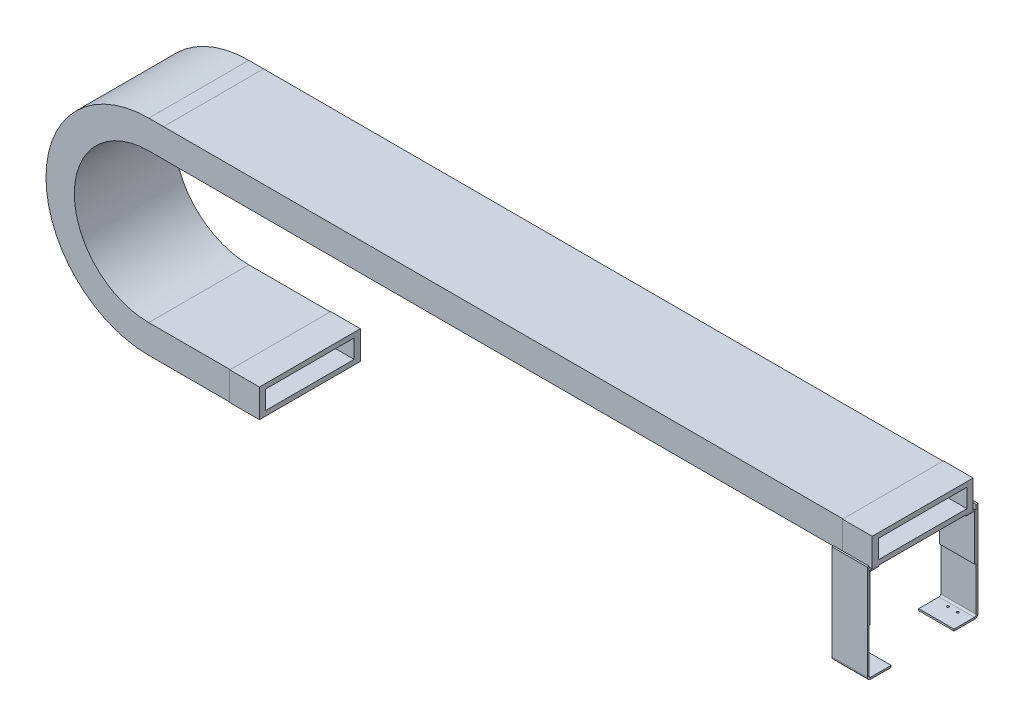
ISO-10303-21;
HEADER;
FILE_DESCRIPTION(('STEP AP214'),'2;1');
FILE_NAME('part.step','',(''),(''),'','','');
FILE_SCHEMA(('AUTOMOTIVE_DESIGN { 1 0 10303 214 1 1 1 1 }'));
ENDSEC;
DATA;
#1=APPLICATION_CONTEXT('core data for automotive mechanical design processes');
#2=APPLICATION_PROTOCOL_DEFINITION('international standard','automotive_design',2000,#1);
#3=PRODUCT_CONTEXT('',#1,'mechanical');
#4=PRODUCT('Part','Part','',(#3));
#5=PRODUCT_RELATED_PRODUCT_CATEGORY('part','',(#4));
#6=PRODUCT_DEFINITION_FORMATION('','',#4);
#7=PRODUCT_DEFINITION_CONTEXT('part definition',#1,'design');
#8=PRODUCT_DEFINITION('design','',#6,#7);
#9=PRODUCT_DEFINITION_SHAPE('','',#8);
#10=(LENGTH_UNIT() NAMED_UNIT(*) SI_UNIT(.MILLI.,.METRE.));
#11=(NAMED_UNIT(*) PLANE_ANGLE_UNIT() SI_UNIT($,.RADIAN.));
#12=(NAMED_UNIT(*) SI_UNIT($,.STERADIAN.) SOLID_ANGLE_UNIT());
#13=UNCERTAINTY_MEASURE_WITH_UNIT(LENGTH_MEASURE(1.E-05),#10,'distance_accuracy_value','');
#14=(GEOMETRIC_REPRESENTATION_CONTEXT(3) GLOBAL_UNCERTAINTY_ASSIGNED_CONTEXT((#13)) GLOBAL_UNIT_ASSIGNED_CONTEXT((#10,
#11,#12)) REPRESENTATION_CONTEXT('',''));
#15=CARTESIAN_POINT('',(0.,0.,0.));
#16=DIRECTION('',(0.,0.,1.));
#17=DIRECTION('',(1.,0.,0.));
#18=AXIS2_PLACEMENT_3D('',#15,#16,#17);
#19=CARTESIAN_POINT('',(-251.,0.,113.));
#20=DIRECTION('',(0.,1.,0.));
#21=DIRECTION('',(0.,0.,1.));
#22=AXIS2_PLACEMENT_3D('',#19,#20,#21);
#23=PLANE('',#22);
#24=DIRECTION('',(0.,0.,1.));
#25=VECTOR('',#24,1.);
#26=CARTESIAN_POINT('',(-251.,0.,113.));
#27=LINE('',#26,#25);
#28=CARTESIAN_POINT('',(-251.,0.,-113.));
#29=VERTEX_POINT('',#28);
#30=CARTESIAN_POINT('',(-251.,0.,113.));
#31=VERTEX_POINT('',#30);
#32=EDGE_CURVE('P0_E314',#29,#31,#27,.T.);
#33=ORIENTED_EDGE('',*,*,#32,.F.);
#34=DIRECTION('',(1.,0.,0.));
#35=VECTOR('',#34,1.);
#36=CARTESIAN_POINT('',(-251.,0.,-113.));
#37=LINE('',#36,#35);
#38=CARTESIAN_POINT('',(-67.0000000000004,0.,-113.));
#39=VERTEX_POINT('',#38);
#40=EDGE_CURVE('P0_E31',#29,#39,#37,.T.);
#41=ORIENTED_EDGE('',*,*,#40,.T.);
#42=DIRECTION('',(0.,0.,1.));
#43=VECTOR('',#42,1.);
#44=CARTESIAN_POINT('',(-67.0000000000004,0.,113.));
#45=LINE('',#44,#43);
#46=CARTESIAN_POINT('',(-67.0000000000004,0.,113.));
#47=VERTEX_POINT('',#46);
#48=EDGE_CURVE('P0_E38',#39,#47,#45,.T.);
#49=ORIENTED_EDGE('',*,*,#48,.T.);
#50=DIRECTION('',(1.,0.,0.));
#51=VECTOR('',#50,1.);
#52=CARTESIAN_POINT('',(-251.,0.,113.));
#53=LINE('',#52,#51);
#54=EDGE_CURVE('P0_E13',#31,#47,#53,.T.);
#55=ORIENTED_EDGE('',*,*,#54,.F.);
#56=EDGE_LOOP('',(#33,#41,#49,#55));
#57=FACE_BOUND('',#56,.T.);
#58=ADVANCED_FACE('P0_F24',(#57),#23,.F.);
#59=CARTESIAN_POINT('',(-251.,64.,113.));
#60=DIRECTION('',(0.,-1.,0.));
#61=DIRECTION('',(0.,0.,-1.));
#62=AXIS2_PLACEMENT_3D('',#59,#60,#61);
#63=PLANE('',#62);
#64=DIRECTION('',(0.,0.,-1.));
#65=VECTOR('',#64,1.);
#66=CARTESIAN_POINT('',(-251.,64.,113.));
#67=LINE('',#66,#65);
#68=CARTESIAN_POINT('',(-251.,64.,113.));
#69=VERTEX_POINT('',#68);
#70=CARTESIAN_POINT('',(-251.,64.,-113.));
#71=VERTEX_POINT('',#70);
#72=EDGE_CURVE('P0_E311',#69,#71,#67,.T.);
#73=ORIENTED_EDGE('',*,*,#72,.F.);
#74=DIRECTION('',(1.,0.,0.));
#75=VECTOR('',#74,1.);
#76=CARTESIAN_POINT('',(-251.,64.,113.));
#77=LINE('',#76,#75);
#78=CARTESIAN_POINT('',(-67.0000000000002,64.,113.));
#79=VERTEX_POINT('',#78);
#80=EDGE_CURVE('P0_E337',#69,#79,#77,.T.);
#81=ORIENTED_EDGE('',*,*,#80,.T.);
#82=DIRECTION('',(0.,0.,-1.));
#83=VECTOR('',#82,1.);
#84=CARTESIAN_POINT('',(-67.0000000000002,64.,113.));
#85=LINE('',#84,#83);
#86=CARTESIAN_POINT('',(-67.0000000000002,64.,-113.));
#87=VERTEX_POINT('',#86);
#88=EDGE_CURVE('P0_E332',#79,#87,#85,.T.);
#89=ORIENTED_EDGE('',*,*,#88,.T.);
#90=DIRECTION('',(1.,0.,0.));
#91=VECTOR('',#90,1.);
#92=CARTESIAN_POINT('',(-251.,64.,-113.));
#93=LINE('',#92,#91);
#94=EDGE_CURVE('P0_E350',#71,#87,#93,.T.);
#95=ORIENTED_EDGE('',*,*,#94,.F.);
#96=EDGE_LOOP('',(#73,#81,#89,#95));
#97=FACE_BOUND('',#96,.T.);
#98=ADVANCED_FACE('P0_F429',(#97),#63,.F.);
#99=CARTESIAN_POINT('',(-251.,53.,100.));
#100=DIRECTION('',(0.,-1.,0.));
#101=DIRECTION('',(0.,0.,-1.));
#102=AXIS2_PLACEMENT_3D('',#99,#100,#101);
#103=PLANE('',#102);
#104=DIRECTION('',(0.,0.,-1.));
#105=VECTOR('',#104,1.);
#106=CARTESIAN_POINT('',(-251.,53.,100.));
#107=LINE('',#106,#105);
#108=CARTESIAN_POINT('',(-251.,53.,100.));
#109=VERTEX_POINT('',#108);
#110=CARTESIAN_POINT('',(-251.,53.,-100.));
#111=VERTEX_POINT('',#110);
#112=EDGE_CURVE('P0_E308',#109,#111,#107,.T.);
#113=ORIENTED_EDGE('',*,*,#112,.T.);
#114=DIRECTION('',(1.,0.,0.));
#115=VECTOR('',#114,1.);
#116=CARTESIAN_POINT('',(-251.,53.,-100.));
#117=LINE('',#116,#115);
#118=CARTESIAN_POINT('',(-67.0000000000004,53.,-100.));
#119=VERTEX_POINT('',#118);
#120=EDGE_CURVE('P0_E343',#111,#119,#117,.T.);
#121=ORIENTED_EDGE('',*,*,#120,.T.);
#122=DIRECTION('',(0.,0.,-1.));
#123=VECTOR('',#122,1.);
#124=CARTESIAN_POINT('',(-67.0000000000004,53.,100.));
#125=LINE('',#124,#123);
#126=CARTESIAN_POINT('',(-67.0000000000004,53.,100.));
#127=VERTEX_POINT('',#126);
#128=EDGE_CURVE('P0_E326',#127,#119,#125,.T.);
#129=ORIENTED_EDGE('',*,*,#128,.F.);
#130=DIRECTION('',(1.,0.,0.));
#131=VECTOR('',#130,1.);
#132=CARTESIAN_POINT('',(-251.,53.,100.));
#133=LINE('',#132,#131);
#134=EDGE_CURVE('P0_E333',#109,#127,#133,.T.);
#135=ORIENTED_EDGE('',*,*,#134,.F.);
#136=EDGE_LOOP('',(#113,#121,#129,#135));
#137=FACE_BOUND('',#136,.T.);
#138=ADVANCED_FACE('P0_F447',(#137),#103,.T.);
#139=CARTESIAN_POINT('',(-251.,11.,100.));
#140=DIRECTION('',(0.,1.,0.));
#141=DIRECTION('',(0.,0.,1.));
#142=AXIS2_PLACEMENT_3D('',#139,#140,#141);
#143=PLANE('',#142);
#144=DIRECTION('',(0.,0.,1.));
#145=VECTOR('',#144,1.);
#146=CARTESIAN_POINT('',(-251.,11.,100.));
#147=LINE('',#146,#145);
#148=CARTESIAN_POINT('',(-251.,11.,-100.));
#149=VERTEX_POINT('',#148);
#150=CARTESIAN_POINT('',(-251.,11.,100.));
#151=VERTEX_POINT('',#150);
#152=EDGE_CURVE('P0_E305',#149,#151,#147,.T.);
#153=ORIENTED_EDGE('',*,*,#152,.T.);
#154=DIRECTION('',(1.,0.,0.));
#155=VECTOR('',#154,1.);
#156=CARTESIAN_POINT('',(-251.,11.,100.));
#157=LINE('',#156,#155);
#158=CARTESIAN_POINT('',(-67.0000000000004,11.,100.));
#159=VERTEX_POINT('',#158);
#160=EDGE_CURVE('P0_E329',#151,#159,#157,.T.);
#161=ORIENTED_EDGE('',*,*,#160,.T.);
#162=DIRECTION('',(0.,0.,1.));
#163=VECTOR('',#162,1.);
#164=CARTESIAN_POINT('',(-67.0000000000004,11.,100.));
#165=LINE('',#164,#163);
#166=CARTESIAN_POINT('',(-67.0000000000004,11.,-100.));
#167=VERTEX_POINT('',#166);
#168=EDGE_CURVE('P0_E320',#167,#159,#165,.T.);
#169=ORIENTED_EDGE('',*,*,#168,.F.);
#170=DIRECTION('',(1.,0.,0.));
#171=VECTOR('',#170,1.);
#172=CARTESIAN_POINT('',(-251.,11.,-100.));
#173=LINE('',#172,#171);
#174=EDGE_CURVE('P0_E340',#149,#167,#173,.T.);
#175=ORIENTED_EDGE('',*,*,#174,.F.);
#176=EDGE_LOOP('',(#153,#161,#169,#175));
#177=FACE_BOUND('',#176,.T.);
#178=ADVANCED_FACE('P0_F451',(#177),#143,.T.);
#179=CARTESIAN_POINT('',(-251.,232.01,0.));
#180=DIRECTION('',(0.,0.,1.));
#181=DIRECTION('',(1.,0.,0.));
#182=AXIS2_PLACEMENT_3D('',#179,#180,#181);
#183=CYLINDRICAL_SURFACE('',#182,232.01);
#184=DIRECTION('',(0.,0.,1.));
#185=VECTOR('',#184,1.);
#186=CARTESIAN_POINT('',(-250.860947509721,464.019958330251,113.));
#187=LINE('',#186,#185);
#188=CARTESIAN_POINT('',(-250.860947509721,464.019958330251,-113.));
#189=VERTEX_POINT('',#188);
#190=CARTESIAN_POINT('',(-250.860947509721,464.019958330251,113.));
#191=VERTEX_POINT('',#190);
#192=EDGE_CURVE('P0_E264',#189,#191,#187,.T.);
#193=ORIENTED_EDGE('',*,*,#192,.F.);
#194=CARTESIAN_POINT('',(-251.,232.01,-113.));
#195=DIRECTION('',(0.,0.,1.));
#196=DIRECTION('',(1.,0.,0.));
#197=AXIS2_PLACEMENT_3D('',#194,#195,#196);
#198=CIRCLE('',#197,232.01);
#199=EDGE_CURVE('P0_E301',#189,#29,#198,.T.);
#200=ORIENTED_EDGE('',*,*,#199,.T.);
#201=ORIENTED_EDGE('',*,*,#32,.T.);
#202=CARTESIAN_POINT('',(-251.,232.01,113.));
#203=DIRECTION('',(0.,0.,1.));
#204=DIRECTION('',(1.,0.,0.));
#205=AXIS2_PLACEMENT_3D('',#202,#203,#204);
#206=CIRCLE('',#205,232.01);
#207=EDGE_CURVE('P0_E303',#191,#31,#206,.T.);
#208=ORIENTED_EDGE('',*,*,#207,.F.);
#209=EDGE_LOOP('',(#193,#200,#201,#208));
#210=FACE_BOUND('',#209,.T.);
#211=ADVANCED_FACE('P0_F357',(#210),#183,.T.);
#212=CARTESIAN_POINT('',(-251.,232.01,0.));
#213=DIRECTION('',(0.,0.,1.));
#214=DIRECTION('',(1.,0.,0.));
#215=AXIS2_PLACEMENT_3D('',#212,#213,#214);
#216=CYLINDRICAL_SURFACE('',#215,168.01);
#217=DIRECTION('',(0.,0.,-1.));
#218=VECTOR('',#217,1.);
#219=CARTESIAN_POINT('',(-250.899305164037,400.019969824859,113.));
#220=LINE('',#219,#218);
#221=CARTESIAN_POINT('',(-250.899305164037,400.019969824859,113.));
#222=VERTEX_POINT('',#221);
#223=CARTESIAN_POINT('',(-250.899305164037,400.019969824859,-113.));
#224=VERTEX_POINT('',#223);
#225=EDGE_CURVE('P0_E261',#222,#224,#220,.T.);
#226=ORIENTED_EDGE('',*,*,#225,.F.);
#227=CARTESIAN_POINT('',(-251.,232.01,113.));
#228=DIRECTION('',(0.,0.,1.));
#229=DIRECTION('',(1.,0.,0.));
#230=AXIS2_PLACEMENT_3D('',#227,#228,#229);
#231=CIRCLE('',#230,168.01);
#232=EDGE_CURVE('P0_E297',#222,#69,#231,.T.);
#233=ORIENTED_EDGE('',*,*,#232,.T.);
#234=ORIENTED_EDGE('',*,*,#72,.T.);
#235=CARTESIAN_POINT('',(-251.,232.01,-113.));
#236=DIRECTION('',(0.,0.,1.));
#237=DIRECTION('',(1.,0.,0.));
#238=AXIS2_PLACEMENT_3D('',#235,#236,#237);
#239=CIRCLE('',#238,168.01);
#240=EDGE_CURVE('P0_E299',#224,#71,#239,.T.);
#241=ORIENTED_EDGE('',*,*,#240,.F.);
#242=EDGE_LOOP('',(#226,#233,#234,#241));
#243=FACE_BOUND('',#242,.T.);
#244=ADVANCED_FACE('P0_F424',(#243),#216,.F.);
#245=CARTESIAN_POINT('',(-251.,232.01,0.));
#246=DIRECTION('',(0.,0.,1.));
#247=DIRECTION('',(1.,0.,0.));
#248=AXIS2_PLACEMENT_3D('',#245,#246,#247);
#249=CYLINDRICAL_SURFACE('',#248,179.01);
#250=DIRECTION('',(0.,0.,-1.));
#251=VECTOR('',#250,1.);
#252=CARTESIAN_POINT('',(-250.892712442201,411.019967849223,100.));
#253=LINE('',#252,#251);
#254=CARTESIAN_POINT('',(-250.892712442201,411.019967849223,100.));
#255=VERTEX_POINT('',#254);
#256=CARTESIAN_POINT('',(-250.892712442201,411.019967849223,-100.));
#257=VERTEX_POINT('',#256);
#258=EDGE_CURVE('P0_E258',#255,#257,#253,.T.);
#259=ORIENTED_EDGE('',*,*,#258,.T.);
#260=CARTESIAN_POINT('',(-251.,232.01,-100.));
#261=DIRECTION('',(0.,0.,1.));
#262=DIRECTION('',(1.,0.,0.));
#263=AXIS2_PLACEMENT_3D('',#260,#261,#262);
#264=CIRCLE('',#263,179.01);
#265=EDGE_CURVE('P0_E293',#257,#111,#264,.T.);
#266=ORIENTED_EDGE('',*,*,#265,.T.);
#267=ORIENTED_EDGE('',*,*,#112,.F.);
#268=CARTESIAN_POINT('',(-251.,232.01,100.));
#269=DIRECTION('',(0.,0.,1.));
#270=DIRECTION('',(1.,0.,0.));
#271=AXIS2_PLACEMENT_3D('',#268,#269,#270);
#272=CIRCLE('',#271,179.01);
#273=EDGE_CURVE('P0_E295',#255,#109,#272,.T.);
#274=ORIENTED_EDGE('',*,*,#273,.F.);
#275=EDGE_LOOP('',(#259,#266,#267,#274));
#276=FACE_BOUND('',#275,.T.);
#277=ADVANCED_FACE('P0_F462',(#276),#249,.T.);
#278=CARTESIAN_POINT('',(-251.,232.01,0.));
#279=DIRECTION('',(0.,0.,1.));
#280=DIRECTION('',(1.,0.,0.));
#281=AXIS2_PLACEMENT_3D('',#278,#279,#280);
#282=CYLINDRICAL_SURFACE('',#281,221.01);
#283=DIRECTION('',(0.,0.,1.));
#284=VECTOR('',#283,1.);
#285=CARTESIAN_POINT('',(-250.867540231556,453.019960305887,100.));
#286=LINE('',#285,#284);
#287=CARTESIAN_POINT('',(-250.867540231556,453.019960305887,-100.));
#288=VERTEX_POINT('',#287);
#289=CARTESIAN_POINT('',(-250.867540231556,453.019960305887,100.));
#290=VERTEX_POINT('',#289);
#291=EDGE_CURVE('P0_E255',#288,#290,#286,.T.);
#292=ORIENTED_EDGE('',*,*,#291,.T.);
#293=CARTESIAN_POINT('',(-251.,232.01,100.));
#294=DIRECTION('',(0.,0.,1.));
#295=DIRECTION('',(1.,0.,0.));
#296=AXIS2_PLACEMENT_3D('',#293,#294,#295);
#297=CIRCLE('',#296,221.01);
#298=EDGE_CURVE('P0_E289',#290,#151,#297,.T.);
#299=ORIENTED_EDGE('',*,*,#298,.T.);
#300=ORIENTED_EDGE('',*,*,#152,.F.);
#301=CARTESIAN_POINT('',(-251.,232.01,-100.));
#302=DIRECTION('',(0.,0.,1.));
#303=DIRECTION('',(1.,0.,0.));
#304=AXIS2_PLACEMENT_3D('',#301,#302,#303);
#305=CIRCLE('',#304,221.01);
#306=EDGE_CURVE('P0_E291',#288,#149,#305,.T.);
#307=ORIENTED_EDGE('',*,*,#306,.F.);
#308=EDGE_LOOP('',(#292,#299,#300,#307));
#309=FACE_BOUND('',#308,.T.);
#310=ADVANCED_FACE('P0_F465',(#309),#282,.F.);
#311=CARTESIAN_POINT('',(-217.610694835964,464.000030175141,113.));
#312=DIRECTION('',(-0.000599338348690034,-0.999999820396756,0.));
#313=DIRECTION('',(0.999999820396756,-0.000599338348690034,0.));
#314=AXIS2_PLACEMENT_3D('',#311,#312,#313);
#315=PLANE('',#314);
#316=DIRECTION('',(0.,0.,1.));
#317=VECTOR('',#316,1.);
#318=CARTESIAN_POINT('',(-217.610694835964,464.000030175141,113.));
#319=LINE('',#318,#317);
#320=CARTESIAN_POINT('',(-217.610694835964,464.000030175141,-113.));
#321=VERTEX_POINT('',#320);
#322=CARTESIAN_POINT('',(-217.610694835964,464.000030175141,113.));
#323=VERTEX_POINT('',#322);
#324=EDGE_CURVE('P0_E233',#321,#323,#319,.T.);
#325=ORIENTED_EDGE('',*,*,#324,.F.);
#326=DIRECTION('',(-0.999999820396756,0.000599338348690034,0.));
#327=VECTOR('',#326,1.);
#328=CARTESIAN_POINT('',(-217.610694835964,464.000030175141,-113.));
#329=LINE('',#328,#327);
#330=EDGE_CURVE('P0_E283',#321,#189,#329,.T.);
#331=ORIENTED_EDGE('',*,*,#330,.T.);
#332=ORIENTED_EDGE('',*,*,#192,.T.);
#333=DIRECTION('',(-0.999999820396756,0.000599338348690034,0.));
#334=VECTOR('',#333,1.);
#335=CARTESIAN_POINT('',(-217.610694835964,464.000030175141,113.));
#336=LINE('',#335,#334);
#337=EDGE_CURVE('P0_E286',#323,#191,#336,.T.);
#338=ORIENTED_EDGE('',*,*,#337,.F.);
#339=EDGE_LOOP('',(#325,#331,#332,#338));
#340=FACE_BOUND('',#339,.T.);
#341=ADVANCED_FACE('P0_F359',(#340),#315,.F.);
#342=CARTESIAN_POINT('',(-217.64905249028,400.000041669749,113.));
#343=DIRECTION('',(0.000599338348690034,0.999999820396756,0.));
#344=DIRECTION('',(-0.999999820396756,0.000599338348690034,0.));
#345=AXIS2_PLACEMENT_3D('',#342,#343,#344);
#346=PLANE('',#345);
#347=DIRECTION('',(0.,0.,-1.));
#348=VECTOR('',#347,1.);
#349=CARTESIAN_POINT('',(-217.64905249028,400.000041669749,113.));
#350=LINE('',#349,#348);
#351=CARTESIAN_POINT('',(-217.64905249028,400.000041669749,113.));
#352=VERTEX_POINT('',#351);
#353=CARTESIAN_POINT('',(-217.64905249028,400.000041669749,-113.));
#354=VERTEX_POINT('',#353);
#355=EDGE_CURVE('P0_E230',#352,#354,#350,.T.);
#356=ORIENTED_EDGE('',*,*,#355,.F.);
#357=DIRECTION('',(-0.999999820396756,0.000599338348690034,0.));
#358=VECTOR('',#357,1.);
#359=CARTESIAN_POINT('',(-217.64905249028,400.000041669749,113.));
#360=LINE('',#359,#358);
#361=EDGE_CURVE('P0_E268',#352,#222,#360,.T.);
#362=ORIENTED_EDGE('',*,*,#361,.T.);
#363=ORIENTED_EDGE('',*,*,#225,.T.);
#364=DIRECTION('',(-0.999999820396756,0.000599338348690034,0.));
#365=VECTOR('',#364,1.);
#366=CARTESIAN_POINT('',(-217.64905249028,400.000041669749,-113.));
#367=LINE('',#366,#365);
#368=EDGE_CURVE('P0_E280',#354,#224,#367,.T.);
#369=ORIENTED_EDGE('',*,*,#368,.F.);
#370=EDGE_LOOP('',(#356,#362,#363,#369));
#371=FACE_BOUND('',#370,.T.);
#372=ADVANCED_FACE('P0_F421',(#371),#346,.F.);
#373=CARTESIAN_POINT('',(-217.642459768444,411.000039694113,100.));
#374=DIRECTION('',(0.000599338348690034,0.999999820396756,0.));
#375=DIRECTION('',(-0.999999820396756,0.000599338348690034,0.));
#376=AXIS2_PLACEMENT_3D('',#373,#374,#375);
#377=PLANE('',#376);
#378=DIRECTION('',(0.,0.,-1.));
#379=VECTOR('',#378,1.);
#380=CARTESIAN_POINT('',(-217.642459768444,411.000039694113,100.));
#381=LINE('',#380,#379);
#382=CARTESIAN_POINT('',(-217.642459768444,411.000039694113,100.));
#383=VERTEX_POINT('',#382);
#384=CARTESIAN_POINT('',(-217.642459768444,411.000039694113,-100.));
#385=VERTEX_POINT('',#384);
#386=EDGE_CURVE('P0_E200',#383,#385,#381,.T.);
#387=ORIENTED_EDGE('',*,*,#386,.T.);
#388=DIRECTION('',(-0.999999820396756,0.000599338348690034,0.));
#389=VECTOR('',#388,1.);
#390=CARTESIAN_POINT('',(-217.642459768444,411.000039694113,-100.));
#391=LINE('',#390,#389);
#392=EDGE_CURVE('P0_E273',#385,#257,#391,.T.);
#393=ORIENTED_EDGE('',*,*,#392,.T.);
#394=ORIENTED_EDGE('',*,*,#258,.F.);
#395=DIRECTION('',(-0.999999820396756,0.000599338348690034,0.));
#396=VECTOR('',#395,1.);
#397=CARTESIAN_POINT('',(-217.642459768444,411.000039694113,100.));
#398=LINE('',#397,#396);
#399=EDGE_CURVE('P0_E265',#383,#255,#398,.T.);
#400=ORIENTED_EDGE('',*,*,#399,.F.);
#401=EDGE_LOOP('',(#387,#393,#394,#400));
#402=FACE_BOUND('',#401,.T.);
#403=ADVANCED_FACE('P0_F474',(#402),#377,.T.);
#404=CARTESIAN_POINT('',(-217.6172875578,453.000032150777,100.));
#405=DIRECTION('',(-0.000599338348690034,-0.999999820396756,0.));
#406=DIRECTION('',(0.999999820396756,-0.000599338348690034,0.));
#407=AXIS2_PLACEMENT_3D('',#404,#405,#406);
#408=PLANE('',#407);
#409=DIRECTION('',(0.,0.,1.));
#410=VECTOR('',#409,1.);
#411=CARTESIAN_POINT('',(-217.6172875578,453.000032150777,100.));
#412=LINE('',#411,#410);
#413=CARTESIAN_POINT('',(-217.6172875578,453.000032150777,-100.));
#414=VERTEX_POINT('',#413);
#415=CARTESIAN_POINT('',(-217.6172875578,453.000032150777,100.));
#416=VERTEX_POINT('',#415);
#417=EDGE_CURVE('P0_E225',#414,#416,#412,.T.);
#418=ORIENTED_EDGE('',*,*,#417,.T.);
#419=DIRECTION('',(-0.999999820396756,0.000599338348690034,0.));
#420=VECTOR('',#419,1.);
#421=CARTESIAN_POINT('',(-217.6172875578,453.000032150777,100.));
#422=LINE('',#421,#420);
#423=EDGE_CURVE('P0_E195',#416,#290,#422,.T.);
#424=ORIENTED_EDGE('',*,*,#423,.T.);
#425=ORIENTED_EDGE('',*,*,#291,.F.);
#426=DIRECTION('',(-0.999999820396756,0.000599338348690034,0.));
#427=VECTOR('',#426,1.);
#428=CARTESIAN_POINT('',(-217.6172875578,453.000032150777,-100.));
#429=LINE('',#428,#427);
#430=EDGE_CURVE('P0_E270',#414,#288,#429,.T.);
#431=ORIENTED_EDGE('',*,*,#430,.F.);
#432=EDGE_LOOP('',(#418,#424,#425,#431));
#433=FACE_BOUND('',#432,.T.);
#434=ADVANCED_FACE('P0_F477',(#433),#408,.T.);
#435=CARTESIAN_POINT('',(-217.51,632.01,0.));
#436=DIRECTION('',(0.,0.,-1.));
#437=DIRECTION('',(-1.,0.,0.));
#438=AXIS2_PLACEMENT_3D('',#435,#436,#437);
#439=CYLINDRICAL_SURFACE('',#438,168.01);
#440=DIRECTION('',(0.,0.,1.));
#441=VECTOR('',#440,1.);
#442=CARTESIAN_POINT('',(-217.51,464.,113.));
#443=LINE('',#442,#441);
#444=CARTESIAN_POINT('',(-217.51,464.,-113.));
#445=VERTEX_POINT('',#444);
#446=CARTESIAN_POINT('',(-217.51,464.,113.));
#447=VERTEX_POINT('',#446);
#448=EDGE_CURVE('P0_E216',#445,#447,#443,.T.);
#449=ORIENTED_EDGE('',*,*,#448,.F.);
#450=CARTESIAN_POINT('',(-217.51,632.01,-113.));
#451=DIRECTION('',(0.,0.,-1.));
#452=DIRECTION('',(-1.,0.,0.));
#453=AXIS2_PLACEMENT_3D('',#450,#451,#452);
#454=CIRCLE('',#453,168.01);
#455=EDGE_CURVE('P0_E249',#445,#321,#454,.T.);
#456=ORIENTED_EDGE('',*,*,#455,.T.);
#457=ORIENTED_EDGE('',*,*,#324,.T.);
#458=CARTESIAN_POINT('',(-217.51,632.01,113.));
#459=DIRECTION('',(0.,0.,-1.));
#460=DIRECTION('',(-1.,0.,0.));
#461=AXIS2_PLACEMENT_3D('',#458,#459,#460);
#462=CIRCLE('',#461,168.01);
#463=EDGE_CURVE('P0_E252',#447,#323,#462,.T.);
#464=ORIENTED_EDGE('',*,*,#463,.F.);
#465=EDGE_LOOP('',(#449,#456,#457,#464));
#466=FACE_BOUND('',#465,.T.);
#467=ADVANCED_FACE('P0_F362',(#466),#439,.F.);
#468=CARTESIAN_POINT('',(-217.51,632.01,0.));
#469=DIRECTION('',(0.,0.,-1.));
#470=DIRECTION('',(-1.,0.,0.));
#471=AXIS2_PLACEMENT_3D('',#468,#469,#470);
#472=CYLINDRICAL_SURFACE('',#471,232.01);
#473=DIRECTION('',(0.,0.,-1.));
#474=VECTOR('',#473,1.);
#475=CARTESIAN_POINT('',(-217.51,400.,113.));
#476=LINE('',#475,#474);
#477=CARTESIAN_POINT('',(-217.51,400.,113.));
#478=VERTEX_POINT('',#477);
#479=CARTESIAN_POINT('',(-217.51,400.,-113.));
#480=VERTEX_POINT('',#479);
#481=EDGE_CURVE('P0_E221',#478,#480,#476,.T.);
#482=ORIENTED_EDGE('',*,*,#481,.F.);
#483=CARTESIAN_POINT('',(-217.51,632.01,113.));
#484=DIRECTION('',(0.,0.,-1.));
#485=DIRECTION('',(-1.,0.,0.));
#486=AXIS2_PLACEMENT_3D('',#483,#484,#485);
#487=CIRCLE('',#486,232.01);
#488=EDGE_CURVE('P0_E236',#478,#352,#487,.T.);
#489=ORIENTED_EDGE('',*,*,#488,.T.);
#490=ORIENTED_EDGE('',*,*,#355,.T.);
#491=CARTESIAN_POINT('',(-217.51,632.01,-113.));
#492=DIRECTION('',(0.,0.,-1.));
#493=DIRECTION('',(-1.,0.,0.));
#494=AXIS2_PLACEMENT_3D('',#491,#492,#493);
#495=CIRCLE('',#494,232.01);
#496=EDGE_CURVE('P0_E246',#480,#354,#495,.T.);
#497=ORIENTED_EDGE('',*,*,#496,.F.);
#498=EDGE_LOOP('',(#482,#489,#490,#497));
#499=FACE_BOUND('',#498,.T.);
#500=ADVANCED_FACE('P0_F418',(#499),#472,.T.);
#501=CARTESIAN_POINT('',(-217.51,632.01,0.));
#502=DIRECTION('',(0.,0.,-1.));
#503=DIRECTION('',(-1.,0.,0.));
#504=AXIS2_PLACEMENT_3D('',#501,#502,#503);
#505=CYLINDRICAL_SURFACE('',#504,221.01);
#506=DIRECTION('',(0.,0.,-1.));
#507=VECTOR('',#506,1.);
#508=CARTESIAN_POINT('',(-217.51,411.,100.));
#509=LINE('',#508,#507);
#510=CARTESIAN_POINT('',(-217.51,411.,100.));
#511=VERTEX_POINT('',#510);
#512=CARTESIAN_POINT('',(-217.51,411.,-100.));
#513=VERTEX_POINT('',#512);
#514=EDGE_CURVE('P0_E209',#511,#513,#509,.T.);
#515=ORIENTED_EDGE('',*,*,#514,.T.);
#516=CARTESIAN_POINT('',(-217.51,632.01,-100.));
#517=DIRECTION('',(0.,0.,-1.));
#518=DIRECTION('',(-1.,0.,0.));
#519=AXIS2_PLACEMENT_3D('',#516,#517,#518);
#520=CIRCLE('',#519,221.01);
#521=EDGE_CURVE('P0_E239',#513,#385,#520,.T.);
#522=ORIENTED_EDGE('',*,*,#521,.T.);
#523=ORIENTED_EDGE('',*,*,#386,.F.);
#524=CARTESIAN_POINT('',(-217.51,632.01,100.));
#525=DIRECTION('',(0.,0.,-1.));
#526=DIRECTION('',(-1.,0.,0.));
#527=AXIS2_PLACEMENT_3D('',#524,#525,#526);
#528=CIRCLE('',#527,221.01);
#529=EDGE_CURVE('P0_E234',#511,#383,#528,.T.);
#530=ORIENTED_EDGE('',*,*,#529,.F.);
#531=EDGE_LOOP('',(#515,#522,#523,#530));
#532=FACE_BOUND('',#531,.T.);
#533=ADVANCED_FACE('P0_F486',(#532),#505,.F.);
#534=CARTESIAN_POINT('',(-217.51,632.01,0.));
#535=DIRECTION('',(0.,0.,-1.));
#536=DIRECTION('',(-1.,0.,0.));
#537=AXIS2_PLACEMENT_3D('',#534,#535,#536);
#538=CYLINDRICAL_SURFACE('',#537,179.01);
#539=DIRECTION('',(0.,0.,1.));
#540=VECTOR('',#539,1.);
#541=CARTESIAN_POINT('',(-217.51,453.,100.));
#542=LINE('',#541,#540);
#543=CARTESIAN_POINT('',(-217.51,453.,-100.));
#544=VERTEX_POINT('',#543);
#545=CARTESIAN_POINT('',(-217.51,453.,100.));
#546=VERTEX_POINT('',#545);
#547=EDGE_CURVE('P0_E203',#544,#546,#542,.T.);
#548=ORIENTED_EDGE('',*,*,#547,.T.);
#549=CARTESIAN_POINT('',(-217.51,632.01,100.));
#550=DIRECTION('',(0.,0.,-1.));
#551=DIRECTION('',(-1.,0.,0.));
#552=AXIS2_PLACEMENT_3D('',#549,#550,#551);
#553=CIRCLE('',#552,179.01);
#554=EDGE_CURVE('P0_E187',#546,#416,#553,.T.);
#555=ORIENTED_EDGE('',*,*,#554,.T.);
#556=ORIENTED_EDGE('',*,*,#417,.F.);
#557=CARTESIAN_POINT('',(-217.51,632.01,-100.));
#558=DIRECTION('',(0.,0.,-1.));
#559=DIRECTION('',(-1.,0.,0.));
#560=AXIS2_PLACEMENT_3D('',#557,#558,#559);
#561=CIRCLE('',#560,179.01);
#562=EDGE_CURVE('P0_E199',#544,#414,#561,.T.);
#563=ORIENTED_EDGE('',*,*,#562,.F.);
#564=EDGE_LOOP('',(#548,#555,#556,#563));
#565=FACE_BOUND('',#564,.T.);
#566=ADVANCED_FACE('P0_F204',(#565),#538,.T.);
#567=CARTESIAN_POINT('',(-217.51,464.,113.));
#568=DIRECTION('',(0.,0.,1.));
#569=DIRECTION('',(1.,0.,0.));
#570=AXIS2_PLACEMENT_3D('',#567,#568,#569);
#571=PLANE('',#570);
#572=DIRECTION('',(0.,-1.,0.));
#573=VECTOR('',#572,1.);
#574=CARTESIAN_POINT('',(1317.,464.,113.));
#575=LINE('',#574,#573);
#576=CARTESIAN_POINT('',(1317.,464.,113.));
#577=VERTEX_POINT('',#576);
#578=CARTESIAN_POINT('',(1317.,400.,113.));
#579=VERTEX_POINT('',#578);
#580=EDGE_CURVE('P0_E404',#577,#579,#575,.T.);
#581=ORIENTED_EDGE('',*,*,#580,.F.);
#582=DIRECTION('',(1.,0.,0.));
#583=VECTOR('',#582,1.);
#584=CARTESIAN_POINT('',(-217.51,464.,113.));
#585=LINE('',#584,#583);
#586=EDGE_CURVE('P0_E227',#447,#577,#585,.T.);
#587=ORIENTED_EDGE('',*,*,#586,.F.);
#588=ORIENTED_EDGE('',*,*,#463,.T.);
#589=ORIENTED_EDGE('',*,*,#337,.T.);
#590=ORIENTED_EDGE('',*,*,#207,.T.);
#591=ORIENTED_EDGE('',*,*,#54,.T.);
#592=DIRECTION('',(0.,1.,0.));
#593=VECTOR('',#592,1.);
#594=CARTESIAN_POINT('',(-67.0000000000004,0.,113.));
#595=LINE('',#594,#593);
#596=EDGE_CURVE('P0_E330',#47,#79,#595,.T.);
#597=ORIENTED_EDGE('',*,*,#596,.T.);
#598=ORIENTED_EDGE('',*,*,#80,.F.);
#599=ORIENTED_EDGE('',*,*,#232,.F.);
#600=ORIENTED_EDGE('',*,*,#361,.F.);
#601=ORIENTED_EDGE('',*,*,#488,.F.);
#602=DIRECTION('',(1.,0.,0.));
#603=VECTOR('',#602,1.);
#604=CARTESIAN_POINT('',(-217.51,400.,113.));
#605=LINE('',#604,#603);
#606=EDGE_CURVE('P0_E388',#478,#579,#605,.T.);
#607=ORIENTED_EDGE('',*,*,#606,.T.);
#608=EDGE_LOOP('',(#581,#587,#588,#589,#590,#591,#597,#598,#599,#600,#601,#607));
#609=FACE_BOUND('',#608,.T.);
#610=ADVANCED_FACE('P0_F411',(#609),#571,.T.);
#611=CARTESIAN_POINT('',(-217.51,464.,113.));
#612=DIRECTION('',(0.,1.,0.));
#613=DIRECTION('',(-1.,0.,0.));
#614=AXIS2_PLACEMENT_3D('',#611,#612,#613);
#615=PLANE('',#614);
#616=DIRECTION('',(0.,0.,1.));
#617=VECTOR('',#616,1.);
#618=CARTESIAN_POINT('',(1317.,464.,113.));
#619=LINE('',#618,#617);
#620=CARTESIAN_POINT('',(1317.,464.,-113.));
#621=VERTEX_POINT('',#620);
#622=EDGE_CURVE('P0_E210',#621,#577,#619,.T.);
#623=ORIENTED_EDGE('',*,*,#622,.F.);
#624=DIRECTION('',(1.,0.,0.));
#625=VECTOR('',#624,1.);
#626=CARTESIAN_POINT('',(-217.51,464.,-113.));
#627=LINE('',#626,#625);
#628=EDGE_CURVE('P0_E364',#445,#621,#627,.T.);
#629=ORIENTED_EDGE('',*,*,#628,.F.);
#630=ORIENTED_EDGE('',*,*,#448,.T.);
#631=ORIENTED_EDGE('',*,*,#586,.T.);
#632=EDGE_LOOP('',(#623,#629,#630,#631));
#633=FACE_BOUND('',#632,.T.);
#634=ADVANCED_FACE('P0_F380',(#633),#615,.T.);
#635=CARTESIAN_POINT('',(-217.51,464.,-113.));
#636=DIRECTION('',(0.,0.,-1.));
#637=DIRECTION('',(-1.,0.,0.));
#638=AXIS2_PLACEMENT_3D('',#635,#636,#637);
#639=PLANE('',#638);
#640=DIRECTION('',(0.,1.,0.));
#641=VECTOR('',#640,1.);
#642=CARTESIAN_POINT('',(1317.,464.,-113.));
#643=LINE('',#642,#641);
#644=CARTESIAN_POINT('',(1317.,400.,-113.));
#645=VERTEX_POINT('',#644);
#646=EDGE_CURVE('P0_E367',#645,#621,#643,.T.);
#647=ORIENTED_EDGE('',*,*,#646,.F.);
#648=DIRECTION('',(1.,0.,0.));
#649=VECTOR('',#648,1.);
#650=CARTESIAN_POINT('',(-217.51,400.,-113.));
#651=LINE('',#650,#649);
#652=EDGE_CURVE('P0_E371',#480,#645,#651,.T.);
#653=ORIENTED_EDGE('',*,*,#652,.F.);
#654=ORIENTED_EDGE('',*,*,#496,.T.);
#655=ORIENTED_EDGE('',*,*,#368,.T.);
#656=ORIENTED_EDGE('',*,*,#240,.T.);
#657=ORIENTED_EDGE('',*,*,#94,.T.);
#658=DIRECTION('',(0.,-1.,0.));
#659=VECTOR('',#658,1.);
#660=CARTESIAN_POINT('',(-67.0000000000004,0.,-113.));
#661=LINE('',#660,#659);
#662=EDGE_CURVE('P0_E46',#87,#39,#661,.T.);
#663=ORIENTED_EDGE('',*,*,#662,.T.);
#664=ORIENTED_EDGE('',*,*,#40,.F.);
#665=ORIENTED_EDGE('',*,*,#199,.F.);
#666=ORIENTED_EDGE('',*,*,#330,.F.);
#667=ORIENTED_EDGE('',*,*,#455,.F.);
#668=ORIENTED_EDGE('',*,*,#628,.T.);
#669=EDGE_LOOP('',(#647,#653,#654,#655,#656,#657,#663,#664,#665,#666,#667,#668));
#670=FACE_BOUND('',#669,.T.);
#671=ADVANCED_FACE('P0_F353',(#670),#639,.T.);
#672=CARTESIAN_POINT('',(-217.51,453.,100.));
#673=DIRECTION('',(0.,0.,1.));
#674=DIRECTION('',(1.,0.,0.));
#675=AXIS2_PLACEMENT_3D('',#672,#673,#674);
#676=PLANE('',#675);
#677=DIRECTION('',(0.,-1.,0.));
#678=VECTOR('',#677,1.);
#679=CARTESIAN_POINT('',(1317.,453.,100.));
#680=LINE('',#679,#678);
#681=CARTESIAN_POINT('',(1317.,453.,100.));
#682=VERTEX_POINT('',#681);
#683=CARTESIAN_POINT('',(1317.,411.,100.));
#684=VERTEX_POINT('',#683);
#685=EDGE_CURVE('P0_E406',#682,#684,#680,.T.);
#686=ORIENTED_EDGE('',*,*,#685,.T.);
#687=DIRECTION('',(1.,0.,0.));
#688=VECTOR('',#687,1.);
#689=CARTESIAN_POINT('',(-217.51,411.,100.));
#690=LINE('',#689,#688);
#691=EDGE_CURVE('P0_E390',#511,#684,#690,.T.);
#692=ORIENTED_EDGE('',*,*,#691,.F.);
#693=ORIENTED_EDGE('',*,*,#529,.T.);
#694=ORIENTED_EDGE('',*,*,#399,.T.);
#695=ORIENTED_EDGE('',*,*,#273,.T.);
#696=ORIENTED_EDGE('',*,*,#134,.T.);
#697=DIRECTION('',(0.,1.,0.));
#698=VECTOR('',#697,1.);
#699=CARTESIAN_POINT('',(-67.0000000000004,11.,100.));
#700=LINE('',#699,#698);
#701=EDGE_CURVE('P0_E317',#159,#127,#700,.T.);
#702=ORIENTED_EDGE('',*,*,#701,.F.);
#703=ORIENTED_EDGE('',*,*,#160,.F.);
#704=ORIENTED_EDGE('',*,*,#298,.F.);
#705=ORIENTED_EDGE('',*,*,#423,.F.);
#706=ORIENTED_EDGE('',*,*,#554,.F.);
#707=DIRECTION('',(1.,0.,0.));
#708=VECTOR('',#707,1.);
#709=CARTESIAN_POINT('',(-217.51,453.,100.));
#710=LINE('',#709,#708);
#711=EDGE_CURVE('P0_E192',#546,#682,#710,.T.);
#712=ORIENTED_EDGE('',*,*,#711,.T.);
#713=EDGE_LOOP('',(#686,#692,#693,#694,#695,#696,#702,#703,#704,#705,#706,#712));
#714=FACE_BOUND('',#713,.T.);
#715=ADVANCED_FACE('P0_F190',(#714),#676,.F.);
#716=CARTESIAN_POINT('',(-217.51,411.,100.));
#717=DIRECTION('',(0.,-1.,0.));
#718=DIRECTION('',(1.,0.,0.));
#719=AXIS2_PLACEMENT_3D('',#716,#717,#718);
#720=PLANE('',#719);
#721=DIRECTION('',(0.,0.,-1.));
#722=VECTOR('',#721,1.);
#723=CARTESIAN_POINT('',(1317.,411.,100.));
#724=LINE('',#723,#722);
#725=CARTESIAN_POINT('',(1317.,411.,-100.));
#726=VERTEX_POINT('',#725);
#727=EDGE_CURVE('P0_E402',#684,#726,#724,.T.);
#728=ORIENTED_EDGE('',*,*,#727,.T.);
#729=DIRECTION('',(1.,0.,0.));
#730=VECTOR('',#729,1.);
#731=CARTESIAN_POINT('',(-217.51,411.,-100.));
#732=LINE('',#731,#730);
#733=EDGE_CURVE('P0_E218',#513,#726,#732,.T.);
#734=ORIENTED_EDGE('',*,*,#733,.F.);
#735=ORIENTED_EDGE('',*,*,#514,.F.);
#736=ORIENTED_EDGE('',*,*,#691,.T.);
#737=EDGE_LOOP('',(#728,#734,#735,#736));
#738=FACE_BOUND('',#737,.T.);
#739=ADVANCED_FACE('P0_F494',(#738),#720,.F.);
#740=CARTESIAN_POINT('',(-217.51,453.,-100.));
#741=DIRECTION('',(0.,0.,-1.));
#742=DIRECTION('',(-1.,0.,0.));
#743=AXIS2_PLACEMENT_3D('',#740,#741,#742);
#744=PLANE('',#743);
#745=DIRECTION('',(0.,1.,0.));
#746=VECTOR('',#745,1.);
#747=CARTESIAN_POINT('',(1317.,453.,-100.));
#748=LINE('',#747,#746);
#749=CARTESIAN_POINT('',(1317.,453.,-100.));
#750=VERTEX_POINT('',#749);
#751=EDGE_CURVE('P0_E397',#726,#750,#748,.T.);
#752=ORIENTED_EDGE('',*,*,#751,.T.);
#753=DIRECTION('',(1.,0.,0.));
#754=VECTOR('',#753,1.);
#755=CARTESIAN_POINT('',(-217.51,453.,-100.));
#756=LINE('',#755,#754);
#757=EDGE_CURVE('P0_E215',#544,#750,#756,.T.);
#758=ORIENTED_EDGE('',*,*,#757,.F.);
#759=ORIENTED_EDGE('',*,*,#562,.T.);
#760=ORIENTED_EDGE('',*,*,#430,.T.);
#761=ORIENTED_EDGE('',*,*,#306,.T.);
#762=ORIENTED_EDGE('',*,*,#174,.T.);
#763=DIRECTION('',(0.,-1.,0.));
#764=VECTOR('',#763,1.);
#765=CARTESIAN_POINT('',(-67.0000000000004,11.,-100.));
#766=LINE('',#765,#764);
#767=EDGE_CURVE('P0_E323',#119,#167,#766,.T.);
#768=ORIENTED_EDGE('',*,*,#767,.F.);
#769=ORIENTED_EDGE('',*,*,#120,.F.);
#770=ORIENTED_EDGE('',*,*,#265,.F.);
#771=ORIENTED_EDGE('',*,*,#392,.F.);
#772=ORIENTED_EDGE('',*,*,#521,.F.);
#773=ORIENTED_EDGE('',*,*,#733,.T.);
#774=EDGE_LOOP('',(#752,#758,#759,#760,#761,#762,#768,#769,#770,#771,#772,#773));
#775=FACE_BOUND('',#774,.T.);
#776=ADVANCED_FACE('P0_F396',(#775),#744,.F.);
#777=CARTESIAN_POINT('',(-217.51,453.,100.));
#778=DIRECTION('',(0.,1.,0.));
#779=DIRECTION('',(-1.,0.,0.));
#780=AXIS2_PLACEMENT_3D('',#777,#778,#779);
#781=PLANE('',#780);
#782=DIRECTION('',(0.,0.,1.));
#783=VECTOR('',#782,1.);
#784=CARTESIAN_POINT('',(1317.,453.,100.));
#785=LINE('',#784,#783);
#786=EDGE_CURVE('P0_E214',#750,#682,#785,.T.);
#787=ORIENTED_EDGE('',*,*,#786,.T.);
#788=ORIENTED_EDGE('',*,*,#711,.F.);
#789=ORIENTED_EDGE('',*,*,#547,.F.);
#790=ORIENTED_EDGE('',*,*,#757,.T.);
#791=EDGE_LOOP('',(#787,#788,#789,#790));
#792=FACE_BOUND('',#791,.T.);
#793=ADVANCED_FACE('P0_F212',(#792),#781,.F.);
#794=CARTESIAN_POINT('',(-217.51,400.,113.));
#795=DIRECTION('',(0.,-1.,0.));
#796=DIRECTION('',(1.,0.,0.));
#797=AXIS2_PLACEMENT_3D('',#794,#795,#796);
#798=PLANE('',#797);
#799=DIRECTION('',(0.,0.,-1.));
#800=VECTOR('',#799,1.);
#801=CARTESIAN_POINT('',(1317.,400.,113.));
#802=LINE('',#801,#800);
#803=EDGE_CURVE('P0_E378',#579,#645,#802,.T.);
#804=ORIENTED_EDGE('',*,*,#803,.F.);
#805=ORIENTED_EDGE('',*,*,#606,.F.);
#806=ORIENTED_EDGE('',*,*,#481,.T.);
#807=ORIENTED_EDGE('',*,*,#652,.T.);
#808=EDGE_LOOP('',(#804,#805,#806,#807));
#809=FACE_BOUND('',#808,.T.);
#810=ADVANCED_FACE('P0_F416',(#809),#798,.T.);
#811=CARTESIAN_POINT('',(-67.0000000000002,64.,113.));
#812=DIRECTION('',(-1.,0.,0.));
#813=DIRECTION('',(0.,0.,-1.));
#814=AXIS2_PLACEMENT_3D('',#811,#812,#813);
#815=PLANE('',#814);
#816=ORIENTED_EDGE('',*,*,#701,.T.);
#817=ORIENTED_EDGE('',*,*,#128,.T.);
#818=ORIENTED_EDGE('',*,*,#767,.T.);
#819=ORIENTED_EDGE('',*,*,#168,.T.);
#820=EDGE_LOOP('',(#816,#817,#818,#819));
#821=FACE_BOUND('',#820,.T.);
#822=ORIENTED_EDGE('',*,*,#596,.F.);
#823=ORIENTED_EDGE('',*,*,#48,.F.);
#824=ORIENTED_EDGE('',*,*,#662,.F.);
#825=ORIENTED_EDGE('',*,*,#88,.F.);
#826=EDGE_LOOP('',(#822,#823,#824,#825));
#827=FACE_BOUND('',#826,.T.);
#828=ADVANCED_FACE('P0_F432',(#821,#827),#815,.F.);
#829=CARTESIAN_POINT('',(1317.,400.,113.));
#830=DIRECTION('',(1.,0.,0.));
#831=DIRECTION('',(0.,0.,-1.));
#832=AXIS2_PLACEMENT_3D('',#829,#830,#831);
#833=PLANE('',#832);
#834=ORIENTED_EDGE('',*,*,#685,.F.);
#835=ORIENTED_EDGE('',*,*,#786,.F.);
#836=ORIENTED_EDGE('',*,*,#751,.F.);
#837=ORIENTED_EDGE('',*,*,#727,.F.);
#838=EDGE_LOOP('',(#834,#835,#836,#837));
#839=FACE_BOUND('',#838,.T.);
#840=ORIENTED_EDGE('',*,*,#580,.T.);
#841=ORIENTED_EDGE('',*,*,#803,.T.);
#842=ORIENTED_EDGE('',*,*,#646,.T.);
#843=ORIENTED_EDGE('',*,*,#622,.T.);
#844=EDGE_LOOP('',(#840,#841,#842,#843));
#845=FACE_BOUND('',#844,.T.);
#846=ADVANCED_FACE('P0_F376',(#839,#845),#833,.T.);
#847=CLOSED_SHELL('',(#58,#98,#138,#178,#211,#244,#277,#310,#341,#372,#403,#434,#467,#500,#533,
#566,#610,#634,#671,#715,#739,#776,#793,#810,#828,#846));
#848=MANIFOLD_SOLID_BREP('P0_B1',#847);
#849=CARTESIAN_POINT('',(1384.,186.,-117.1));
#850=DIRECTION('',(1.,0.,0.));
#851=DIRECTION('',(0.,0.,-1.));
#852=AXIS2_PLACEMENT_3D('',#849,#850,#851);
#853=PLANE('',#852);
#854=DIRECTION('',(0.,1.,0.));
#855=VECTOR('',#854,1.);
#856=CARTESIAN_POINT('',(1384.,186.,-117.1));
#857=LINE('',#856,#855);
#858=CARTESIAN_POINT('',(1384.,186.,-117.1));
#859=VERTEX_POINT('',#858);
#860=CARTESIAN_POINT('',(1384.,190.,-117.1));
#861=VERTEX_POINT('',#860);
#862=EDGE_CURVE('P1_E11',#859,#861,#857,.T.);
#863=ORIENTED_EDGE('',*,*,#862,.F.);
#864=CARTESIAN_POINT('',(1384.,193.9,-117.1));
#865=DIRECTION('',(1.,0.,0.));
#866=DIRECTION('',(0.,0.,-1.));
#867=AXIS2_PLACEMENT_3D('',#864,#865,#866);
#868=CIRCLE('',#867,7.9);
#869=CARTESIAN_POINT('',(1384.,193.9,-125.));
#870=VERTEX_POINT('',#869);
#871=EDGE_CURVE('P1_E115',#870,#859,#868,.F.);
#872=ORIENTED_EDGE('',*,*,#871,.F.);
#873=DIRECTION('',(0.,0.,-1.));
#874=VECTOR('',#873,1.);
#875=CARTESIAN_POINT('',(1384.,193.9,-121.));
#876=LINE('',#875,#874);
#877=CARTESIAN_POINT('',(1384.,193.9,-121.));
#878=VERTEX_POINT('',#877);
#879=EDGE_CURVE('P1_E25',#878,#870,#876,.T.);
#880=ORIENTED_EDGE('',*,*,#879,.F.);
#881=CARTESIAN_POINT('',(1384.,193.9,-117.1));
#882=DIRECTION('',(1.,0.,0.));
#883=DIRECTION('',(0.,0.,-1.));
#884=AXIS2_PLACEMENT_3D('',#881,#882,#883);
#885=CIRCLE('',#884,3.9);
#886=EDGE_CURVE('P1_E108',#878,#861,#885,.F.);
#887=ORIENTED_EDGE('',*,*,#886,.T.);
#888=EDGE_LOOP('',(#863,#872,#880,#887));
#889=FACE_BOUND('',#888,.T.);
#890=ADVANCED_FACE('P1_F17',(#889),#853,.T.);
#891=CARTESIAN_POINT('',(1384.,193.9,-121.));
#892=DIRECTION('',(1.,0.,0.));
#893=DIRECTION('',(0.,0.,-1.));
#894=AXIS2_PLACEMENT_3D('',#891,#892,#893);
#895=PLANE('',#894);
#896=DIRECTION('',(0.,0.,1.));
#897=VECTOR('',#896,1.);
#898=CARTESIAN_POINT('',(1384.,186.,-125.));
#899=LINE('',#898,#897);
#900=CARTESIAN_POINT('',(1384.,186.,-71.));
#901=VERTEX_POINT('',#900);
#902=EDGE_CURVE('P1_E166',#859,#901,#899,.T.);
#903=ORIENTED_EDGE('',*,*,#902,.F.);
#904=ORIENTED_EDGE('',*,*,#862,.T.);
#905=DIRECTION('',(0.,0.,1.));
#906=VECTOR('',#905,1.);
#907=CARTESIAN_POINT('',(1384.,190.,-125.));
#908=LINE('',#907,#906);
#909=CARTESIAN_POINT('',(1384.,190.,-71.));
#910=VERTEX_POINT('',#909);
#911=EDGE_CURVE('P1_E73',#861,#910,#908,.T.);
#912=ORIENTED_EDGE('',*,*,#911,.T.);
#913=DIRECTION('',(0.,1.,0.));
#914=VECTOR('',#913,1.);
#915=CARTESIAN_POINT('',(1384.,186.,-71.));
#916=LINE('',#915,#914);
#917=EDGE_CURVE('P1_E338',#901,#910,#916,.T.);
#918=ORIENTED_EDGE('',*,*,#917,.F.);
#919=EDGE_LOOP('',(#903,#904,#912,#918));
#920=FACE_BOUND('',#919,.T.);
#921=ADVANCED_FACE('P1_F174',(#920),#895,.T.);
#922=CARTESIAN_POINT('',(1304.,193.9,-125.));
#923=DIRECTION('',(-1.,0.,0.));
#924=DIRECTION('',(0.,0.,1.));
#925=AXIS2_PLACEMENT_3D('',#922,#923,#924);
#926=PLANE('',#925);
#927=DIRECTION('',(0.,0.,1.));
#928=VECTOR('',#927,1.);
#929=CARTESIAN_POINT('',(1304.,193.9,-125.));
#930=LINE('',#929,#928);
#931=CARTESIAN_POINT('',(1304.,193.9,-125.));
#932=VERTEX_POINT('',#931);
#933=CARTESIAN_POINT('',(1304.,193.9,-121.));
#934=VERTEX_POINT('',#933);
#935=EDGE_CURVE('P1_E60',#932,#934,#930,.T.);
#936=ORIENTED_EDGE('',*,*,#935,.F.);
#937=CARTESIAN_POINT('',(1304.,193.9,-117.1));
#938=DIRECTION('',(1.,0.,0.));
#939=DIRECTION('',(0.,0.,-1.));
#940=AXIS2_PLACEMENT_3D('',#937,#938,#939);
#941=CIRCLE('',#940,7.9);
#942=CARTESIAN_POINT('',(1304.,186.,-117.1));
#943=VERTEX_POINT('',#942);
#944=EDGE_CURVE('P1_E132',#932,#943,#941,.F.);
#945=ORIENTED_EDGE('',*,*,#944,.T.);
#946=DIRECTION('',(0.,-1.,0.));
#947=VECTOR('',#946,1.);
#948=CARTESIAN_POINT('',(1304.,190.,-117.1));
#949=LINE('',#948,#947);
#950=CARTESIAN_POINT('',(1304.,190.,-117.1));
#951=VERTEX_POINT('',#950);
#952=EDGE_CURVE('P1_E67',#951,#943,#949,.T.);
#953=ORIENTED_EDGE('',*,*,#952,.F.);
#954=CARTESIAN_POINT('',(1304.,193.9,-117.1));
#955=DIRECTION('',(1.,0.,0.));
#956=DIRECTION('',(0.,0.,-1.));
#957=AXIS2_PLACEMENT_3D('',#954,#955,#956);
#958=CIRCLE('',#957,3.9);
#959=EDGE_CURVE('P1_E139',#934,#951,#958,.F.);
#960=ORIENTED_EDGE('',*,*,#959,.F.);
#961=EDGE_LOOP('',(#936,#945,#953,#960));
#962=FACE_BOUND('',#961,.T.);
#963=ADVANCED_FACE('P1_F172',(#962),#926,.T.);
#964=CARTESIAN_POINT('',(1304.,190.,-117.1));
#965=DIRECTION('',(-1.,0.,0.));
#966=DIRECTION('',(0.,0.,1.));
#967=AXIS2_PLACEMENT_3D('',#964,#965,#966);
#968=PLANE('',#967);
#969=DIRECTION('',(0.,-1.,0.));
#970=VECTOR('',#969,1.);
#971=CARTESIAN_POINT('',(1304.,186.,-125.));
#972=LINE('',#971,#970);
#973=CARTESIAN_POINT('',(1304.,409.,-125.));
#974=VERTEX_POINT('',#973);
#975=EDGE_CURVE('P1_E134',#974,#932,#972,.T.);
#976=ORIENTED_EDGE('',*,*,#975,.T.);
#977=ORIENTED_EDGE('',*,*,#935,.T.);
#978=DIRECTION('',(0.,1.,0.));
#979=VECTOR('',#978,1.);
#980=CARTESIAN_POINT('',(1304.,186.,-121.));
#981=LINE('',#980,#979);
#982=CARTESIAN_POINT('',(1304.,409.,-121.));
#983=VERTEX_POINT('',#982);
#984=EDGE_CURVE('P1_E137',#983,#934,#981,.F.);
#985=ORIENTED_EDGE('',*,*,#984,.F.);
#986=DIRECTION('',(0.,0.,-1.));
#987=VECTOR('',#986,1.);
#988=CARTESIAN_POINT('',(1304.,409.,-121.));
#989=LINE('',#988,#987);
#990=EDGE_CURVE('P1_E95',#983,#974,#989,.T.);
#991=ORIENTED_EDGE('',*,*,#990,.T.);
#992=EDGE_LOOP('',(#976,#977,#985,#991));
#993=FACE_BOUND('',#992,.T.);
#994=ADVANCED_FACE('P1_F168',(#993),#968,.T.);
#995=CARTESIAN_POINT('',(1384.,190.,-125.));
#996=DIRECTION('',(0.,-1.,0.));
#997=DIRECTION('',(0.,0.,-1.));
#998=AXIS2_PLACEMENT_3D('',#995,#996,#997);
#999=PLANE('',#998);
#1000=CARTESIAN_POINT('',(1332.75,190.,-108.));
#1001=DIRECTION('',(0.,-1.,0.));
#1002=DIRECTION('',(0.,0.,-1.));
#1003=AXIS2_PLACEMENT_3D('',#1000,#1001,#1002);
#1004=CIRCLE('',#1003,2.49999999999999);
#1005=CARTESIAN_POINT('',(1332.75,190.,-110.5));
#1006=VERTEX_POINT('',#1005);
#1007=EDGE_CURVE('P1_E328',#1006,#1006,#1004,.T.);
#1008=ORIENTED_EDGE('',*,*,#1007,.T.);
#1009=EDGE_LOOP('',(#1008));
#1010=FACE_BOUND('',#1009,.T.);
#1011=CARTESIAN_POINT('',(1355.25,190.,-108.));
#1012=DIRECTION('',(0.,-1.,0.));
#1013=DIRECTION('',(0.,0.,-1.));
#1014=AXIS2_PLACEMENT_3D('',#1011,#1012,#1013);
#1015=CIRCLE('',#1014,2.49999999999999);
#1016=CARTESIAN_POINT('',(1355.25,190.,-110.5));
#1017=VERTEX_POINT('',#1016);
#1018=EDGE_CURVE('P1_E126',#1017,#1017,#1015,.T.);
#1019=ORIENTED_EDGE('',*,*,#1018,.T.);
#1020=EDGE_LOOP('',(#1019));
#1021=FACE_BOUND('',#1020,.T.);
#1022=DIRECTION('',(0.,0.,1.));
#1023=VECTOR('',#1022,1.);
#1024=CARTESIAN_POINT('',(1304.,190.,-125.));
#1025=LINE('',#1024,#1023);
#1026=CARTESIAN_POINT('',(1304.,190.,-71.));
#1027=VERTEX_POINT('',#1026);
#1028=EDGE_CURVE('P1_E121',#951,#1027,#1025,.T.);
#1029=ORIENTED_EDGE('',*,*,#1028,.T.);
#1030=DIRECTION('',(-1.,0.,0.));
#1031=VECTOR('',#1030,1.);
#1032=CARTESIAN_POINT('',(1384.,190.,-71.));
#1033=LINE('',#1032,#1031);
#1034=EDGE_CURVE('P1_E153',#910,#1027,#1033,.T.);
#1035=ORIENTED_EDGE('',*,*,#1034,.F.);
#1036=ORIENTED_EDGE('',*,*,#911,.F.);
#1037=DIRECTION('',(-1.,0.,0.));
#1038=VECTOR('',#1037,1.);
#1039=CARTESIAN_POINT('',(1384.,190.,-117.1));
#1040=LINE('',#1039,#1038);
#1041=EDGE_CURVE('P1_E120',#861,#951,#1040,.T.);
#1042=ORIENTED_EDGE('',*,*,#1041,.T.);
#1043=EDGE_LOOP('',(#1029,#1035,#1036,#1042));
#1044=FACE_BOUND('',#1043,.T.);
#1045=ADVANCED_FACE('P1_F181',(#1010,#1021,#1044),#999,.F.);
#1046=CARTESIAN_POINT('',(1384.,186.,-71.));
#1047=DIRECTION('',(0.,0.,1.));
#1048=DIRECTION('',(1.,0.,0.));
#1049=AXIS2_PLACEMENT_3D('',#1046,#1047,#1048);
#1050=PLANE('',#1049);
#1051=DIRECTION('',(0.,1.,0.));
#1052=VECTOR('',#1051,1.);
#1053=CARTESIAN_POINT('',(1304.,186.,-71.));
#1054=LINE('',#1053,#1052);
#1055=CARTESIAN_POINT('',(1304.,186.,-71.));
#1056=VERTEX_POINT('',#1055);
#1057=EDGE_CURVE('P1_E125',#1056,#1027,#1054,.T.);
#1058=ORIENTED_EDGE('',*,*,#1057,.F.);
#1059=DIRECTION('',(-1.,0.,0.));
#1060=VECTOR('',#1059,1.);
#1061=CARTESIAN_POINT('',(1384.,186.,-71.));
#1062=LINE('',#1061,#1060);
#1063=EDGE_CURVE('P1_E151',#901,#1056,#1062,.T.);
#1064=ORIENTED_EDGE('',*,*,#1063,.F.);
#1065=ORIENTED_EDGE('',*,*,#917,.T.);
#1066=ORIENTED_EDGE('',*,*,#1034,.T.);
#1067=EDGE_LOOP('',(#1058,#1064,#1065,#1066));
#1068=FACE_BOUND('',#1067,.T.);
#1069=ADVANCED_FACE('P1_F214',(#1068),#1050,.T.);
#1070=CARTESIAN_POINT('',(1384.,186.,-125.));
#1071=DIRECTION('',(0.,-1.,0.));
#1072=DIRECTION('',(0.,0.,-1.));
#1073=AXIS2_PLACEMENT_3D('',#1070,#1071,#1072);
#1074=PLANE('',#1073);
#1075=CARTESIAN_POINT('',(1332.75,186.,-108.));
#1076=DIRECTION('',(0.,-1.,0.));
#1077=DIRECTION('',(0.,0.,-1.));
#1078=AXIS2_PLACEMENT_3D('',#1075,#1076,#1077);
#1079=CIRCLE('',#1078,2.49999999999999);
#1080=CARTESIAN_POINT('',(1332.75,186.,-110.5));
#1081=VERTEX_POINT('',#1080);
#1082=EDGE_CURVE('P1_E325',#1081,#1081,#1079,.T.);
#1083=ORIENTED_EDGE('',*,*,#1082,.F.);
#1084=EDGE_LOOP('',(#1083));
#1085=FACE_BOUND('',#1084,.T.);
#1086=CARTESIAN_POINT('',(1355.25,186.,-108.));
#1087=DIRECTION('',(0.,-1.,0.));
#1088=DIRECTION('',(0.,0.,-1.));
#1089=AXIS2_PLACEMENT_3D('',#1086,#1087,#1088);
#1090=CIRCLE('',#1089,2.49999999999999);
#1091=CARTESIAN_POINT('',(1355.25,186.,-110.5));
#1092=VERTEX_POINT('',#1091);
#1093=EDGE_CURVE('P1_E329',#1092,#1092,#1090,.T.);
#1094=ORIENTED_EDGE('',*,*,#1093,.F.);
#1095=EDGE_LOOP('',(#1094));
#1096=FACE_BOUND('',#1095,.T.);
#1097=DIRECTION('',(0.,0.,1.));
#1098=VECTOR('',#1097,1.);
#1099=CARTESIAN_POINT('',(1304.,186.,-125.));
#1100=LINE('',#1099,#1098);
#1101=EDGE_CURVE('P1_E129',#943,#1056,#1100,.T.);
#1102=ORIENTED_EDGE('',*,*,#1101,.F.);
#1103=DIRECTION('',(-1.,0.,0.));
#1104=VECTOR('',#1103,1.);
#1105=CARTESIAN_POINT('',(1384.,186.,-117.1));
#1106=LINE('',#1105,#1104);
#1107=EDGE_CURVE('P1_E148',#859,#943,#1106,.T.);
#1108=ORIENTED_EDGE('',*,*,#1107,.F.);
#1109=ORIENTED_EDGE('',*,*,#902,.T.);
#1110=ORIENTED_EDGE('',*,*,#1063,.T.);
#1111=EDGE_LOOP('',(#1102,#1108,#1109,#1110));
#1112=FACE_BOUND('',#1111,.T.);
#1113=ADVANCED_FACE('P1_F224',(#1085,#1096,#1112),#1074,.T.);
#1114=CARTESIAN_POINT('',(1384.,193.9,-117.1));
#1115=DIRECTION('',(-1.,0.,0.));
#1116=DIRECTION('',(0.,0.,1.));
#1117=AXIS2_PLACEMENT_3D('',#1114,#1115,#1116);
#1118=CYLINDRICAL_SURFACE('',#1117,7.9);
#1119=ORIENTED_EDGE('',*,*,#944,.F.);
#1120=DIRECTION('',(-1.,0.,0.));
#1121=VECTOR('',#1120,1.);
#1122=CARTESIAN_POINT('',(1384.,193.9,-125.));
#1123=LINE('',#1122,#1121);
#1124=EDGE_CURVE('P1_E145',#870,#932,#1123,.T.);
#1125=ORIENTED_EDGE('',*,*,#1124,.F.);
#1126=ORIENTED_EDGE('',*,*,#871,.T.);
#1127=ORIENTED_EDGE('',*,*,#1107,.T.);
#1128=EDGE_LOOP('',(#1119,#1125,#1126,#1127));
#1129=FACE_BOUND('',#1128,.T.);
#1130=ADVANCED_FACE('P1_F162',(#1129),#1118,.T.);
#1131=CARTESIAN_POINT('',(1384.,186.,-125.));
#1132=DIRECTION('',(0.,0.,-1.));
#1133=DIRECTION('',(-1.,0.,0.));
#1134=AXIS2_PLACEMENT_3D('',#1131,#1132,#1133);
#1135=PLANE('',#1134);
#1136=ORIENTED_EDGE('',*,*,#975,.F.);
#1137=DIRECTION('',(-1.,0.,0.));
#1138=VECTOR('',#1137,1.);
#1139=CARTESIAN_POINT('',(1384.,409.,-125.));
#1140=LINE('',#1139,#1138);
#1141=CARTESIAN_POINT('',(1384.,409.,-125.));
#1142=VERTEX_POINT('',#1141);
#1143=EDGE_CURVE('P1_E97',#1142,#974,#1140,.T.);
#1144=ORIENTED_EDGE('',*,*,#1143,.F.);
#1145=DIRECTION('',(0.,-1.,0.));
#1146=VECTOR('',#1145,1.);
#1147=CARTESIAN_POINT('',(1384.,186.,-125.));
#1148=LINE('',#1147,#1146);
#1149=EDGE_CURVE('P1_E113',#1142,#870,#1148,.T.);
#1150=ORIENTED_EDGE('',*,*,#1149,.T.);
#1151=ORIENTED_EDGE('',*,*,#1124,.T.);
#1152=EDGE_LOOP('',(#1136,#1144,#1150,#1151));
#1153=FACE_BOUND('',#1152,.T.);
#1154=ADVANCED_FACE('P1_F167',(#1153),#1135,.T.);
#1155=CARTESIAN_POINT('',(1384.,409.,-121.));
#1156=DIRECTION('',(0.,1.,0.));
#1157=DIRECTION('',(0.,0.,1.));
#1158=AXIS2_PLACEMENT_3D('',#1155,#1156,#1157);
#1159=PLANE('',#1158);
#1160=ORIENTED_EDGE('',*,*,#990,.F.);
#1161=DIRECTION('',(-1.,0.,0.));
#1162=VECTOR('',#1161,1.);
#1163=CARTESIAN_POINT('',(1384.,409.,-121.));
#1164=LINE('',#1163,#1162);
#1165=CARTESIAN_POINT('',(1384.,409.,-121.));
#1166=VERTEX_POINT('',#1165);
#1167=EDGE_CURVE('P1_E89',#1166,#983,#1164,.T.);
#1168=ORIENTED_EDGE('',*,*,#1167,.F.);
#1169=DIRECTION('',(0.,0.,-1.));
#1170=VECTOR('',#1169,1.);
#1171=CARTESIAN_POINT('',(1384.,409.,-121.));
#1172=LINE('',#1171,#1170);
#1173=EDGE_CURVE('P1_E93',#1166,#1142,#1172,.T.);
#1174=ORIENTED_EDGE('',*,*,#1173,.T.);
#1175=ORIENTED_EDGE('',*,*,#1143,.T.);
#1176=EDGE_LOOP('',(#1160,#1168,#1174,#1175));
#1177=FACE_BOUND('',#1176,.T.);
#1178=ADVANCED_FACE('P1_F91',(#1177),#1159,.T.);
#1179=CARTESIAN_POINT('',(1384.,186.,-121.));
#1180=DIRECTION('',(0.,0.,-1.));
#1181=DIRECTION('',(-1.,0.,0.));
#1182=AXIS2_PLACEMENT_3D('',#1179,#1180,#1181);
#1183=PLANE('',#1182);
#1184=ORIENTED_EDGE('',*,*,#984,.T.);
#1185=DIRECTION('',(-1.,0.,0.));
#1186=VECTOR('',#1185,1.);
#1187=CARTESIAN_POINT('',(1384.,193.9,-121.));
#1188=LINE('',#1187,#1186);
#1189=EDGE_CURVE('P1_E98',#878,#934,#1188,.T.);
#1190=ORIENTED_EDGE('',*,*,#1189,.F.);
#1191=DIRECTION('',(0.,1.,0.));
#1192=VECTOR('',#1191,1.);
#1193=CARTESIAN_POINT('',(1384.,186.,-121.));
#1194=LINE('',#1193,#1192);
#1195=EDGE_CURVE('P1_E102',#1166,#878,#1194,.F.);
#1196=ORIENTED_EDGE('',*,*,#1195,.F.);
#1197=ORIENTED_EDGE('',*,*,#1167,.T.);
#1198=EDGE_LOOP('',(#1184,#1190,#1196,#1197));
#1199=FACE_BOUND('',#1198,.T.);
#1200=ADVANCED_FACE('P1_F103',(#1199),#1183,.F.);
#1201=CARTESIAN_POINT('',(1384.,193.9,-117.1));
#1202=DIRECTION('',(-1.,0.,0.));
#1203=DIRECTION('',(0.,0.,1.));
#1204=AXIS2_PLACEMENT_3D('',#1201,#1202,#1203);
#1205=CYLINDRICAL_SURFACE('',#1204,3.9);
#1206=ORIENTED_EDGE('',*,*,#959,.T.);
#1207=ORIENTED_EDGE('',*,*,#1041,.F.);
#1208=ORIENTED_EDGE('',*,*,#886,.F.);
#1209=ORIENTED_EDGE('',*,*,#1189,.T.);
#1210=EDGE_LOOP('',(#1206,#1207,#1208,#1209));
#1211=FACE_BOUND('',#1210,.T.);
#1212=ADVANCED_FACE('P1_F170',(#1211),#1205,.F.);
#1213=CARTESIAN_POINT('',(1384.,193.9,-117.1));
#1214=DIRECTION('',(1.,0.,0.));
#1215=DIRECTION('',(0.,0.,-1.));
#1216=AXIS2_PLACEMENT_3D('',#1213,#1214,#1215);
#1217=PLANE('',#1216);
#1218=ORIENTED_EDGE('',*,*,#1195,.T.);
#1219=ORIENTED_EDGE('',*,*,#879,.T.);
#1220=ORIENTED_EDGE('',*,*,#1149,.F.);
#1221=ORIENTED_EDGE('',*,*,#1173,.F.);
#1222=EDGE_LOOP('',(#1218,#1219,#1220,#1221));
#1223=FACE_BOUND('',#1222,.T.);
#1224=ADVANCED_FACE('P1_F111',(#1223),#1217,.T.);
#1225=CARTESIAN_POINT('',(1304.,193.9,-117.1));
#1226=DIRECTION('',(1.,0.,0.));
#1227=DIRECTION('',(0.,0.,-1.));
#1228=AXIS2_PLACEMENT_3D('',#1225,#1226,#1227);
#1229=PLANE('',#1228);
#1230=ORIENTED_EDGE('',*,*,#1028,.F.);
#1231=ORIENTED_EDGE('',*,*,#952,.T.);
#1232=ORIENTED_EDGE('',*,*,#1101,.T.);
#1233=ORIENTED_EDGE('',*,*,#1057,.T.);
#1234=EDGE_LOOP('',(#1230,#1231,#1232,#1233));
#1235=FACE_BOUND('',#1234,.T.);
#1236=ADVANCED_FACE('P1_F286',(#1235),#1229,.F.);
#1237=CARTESIAN_POINT('',(1355.25,186.,-108.));
#1238=DIRECTION('',(0.,-1.,0.));
#1239=DIRECTION('',(0.,0.,-1.));
#1240=AXIS2_PLACEMENT_3D('',#1237,#1238,#1239);
#1241=CYLINDRICAL_SURFACE('',#1240,2.49999999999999);
#1242=ORIENTED_EDGE('',*,*,#1093,.T.);
#1243=EDGE_LOOP('',(#1242));
#1244=FACE_BOUND('',#1243,.T.);
#1245=ORIENTED_EDGE('',*,*,#1018,.F.);
#1246=EDGE_LOOP('',(#1245));
#1247=FACE_BOUND('',#1246,.T.);
#1248=ADVANCED_FACE('P1_F296',(#1244,#1247),#1241,.F.);
#1249=CARTESIAN_POINT('',(1332.75,186.,-108.));
#1250=DIRECTION('',(0.,-1.,0.));
#1251=DIRECTION('',(0.,0.,-1.));
#1252=AXIS2_PLACEMENT_3D('',#1249,#1250,#1251);
#1253=CYLINDRICAL_SURFACE('',#1252,2.49999999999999);
#1254=ORIENTED_EDGE('',*,*,#1082,.T.);
#1255=EDGE_LOOP('',(#1254));
#1256=FACE_BOUND('',#1255,.T.);
#1257=ORIENTED_EDGE('',*,*,#1007,.F.);
#1258=EDGE_LOOP('',(#1257));
#1259=FACE_BOUND('',#1258,.T.);
#1260=ADVANCED_FACE('P1_F306',(#1256,#1259),#1253,.F.);
#1261=CLOSED_SHELL('',(#890,#921,#963,#994,#1045,#1069,#1113,#1130,#1154,#1178,#1200,#1212,
#1224,#1236,#1248,#1260));
#1262=MANIFOLD_SOLID_BREP('P1_B1',#1261);
#1263=CARTESIAN_POINT('',(1304.,186.,117.1));
#1264=DIRECTION('',(-1.,0.,0.));
#1265=DIRECTION('',(0.,0.,1.));
#1266=AXIS2_PLACEMENT_3D('',#1263,#1264,#1265);
#1267=PLANE('',#1266);
#1268=DIRECTION('',(0.,1.,0.));
#1269=VECTOR('',#1268,1.);
#1270=CARTESIAN_POINT('',(1304.,186.,117.1));
#1271=LINE('',#1270,#1269);
#1272=CARTESIAN_POINT('',(1304.,186.,117.1));
#1273=VERTEX_POINT('',#1272);
#1274=CARTESIAN_POINT('',(1304.,190.,117.1));
#1275=VERTEX_POINT('',#1274);
#1276=EDGE_CURVE('P2_E11',#1273,#1275,#1271,.T.);
#1277=ORIENTED_EDGE('',*,*,#1276,.F.);
#1278=CARTESIAN_POINT('',(1304.,193.9,117.1));
#1279=DIRECTION('',(-1.,0.,0.));
#1280=DIRECTION('',(0.,0.,1.));
#1281=AXIS2_PLACEMENT_3D('',#1278,#1279,#1280);
#1282=CIRCLE('',#1281,7.9);
#1283=CARTESIAN_POINT('',(1304.,193.9,125.));
#1284=VERTEX_POINT('',#1283);
#1285=EDGE_CURVE('P2_E115',#1284,#1273,#1282,.F.);
#1286=ORIENTED_EDGE('',*,*,#1285,.F.);
#1287=DIRECTION('',(0.,0.,1.));
#1288=VECTOR('',#1287,1.);
#1289=CARTESIAN_POINT('',(1304.,193.9,121.));
#1290=LINE('',#1289,#1288);
#1291=CARTESIAN_POINT('',(1304.,193.9,121.));
#1292=VERTEX_POINT('',#1291);
#1293=EDGE_CURVE('P2_E25',#1292,#1284,#1290,.T.);
#1294=ORIENTED_EDGE('',*,*,#1293,.F.);
#1295=CARTESIAN_POINT('',(1304.,193.9,117.1));
#1296=DIRECTION('',(-1.,0.,0.));
#1297=DIRECTION('',(0.,0.,1.));
#1298=AXIS2_PLACEMENT_3D('',#1295,#1296,#1297);
#1299=CIRCLE('',#1298,3.9);
#1300=EDGE_CURVE('P2_E108',#1292,#1275,#1299,.F.);
#1301=ORIENTED_EDGE('',*,*,#1300,.T.);
#1302=EDGE_LOOP('',(#1277,#1286,#1294,#1301));
#1303=FACE_BOUND('',#1302,.T.);
#1304=ADVANCED_FACE('P2_F17',(#1303),#1267,.T.);
#1305=CARTESIAN_POINT('',(1304.,193.9,121.));
#1306=DIRECTION('',(-1.,0.,0.));
#1307=DIRECTION('',(0.,0.,1.));
#1308=AXIS2_PLACEMENT_3D('',#1305,#1306,#1307);
#1309=PLANE('',#1308);
#1310=DIRECTION('',(0.,0.,-1.));
#1311=VECTOR('',#1310,1.);
#1312=CARTESIAN_POINT('',(1304.,186.,125.));
#1313=LINE('',#1312,#1311);
#1314=CARTESIAN_POINT('',(1304.,186.,71.0000000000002));
#1315=VERTEX_POINT('',#1314);
#1316=EDGE_CURVE('P2_E166',#1273,#1315,#1313,.T.);
#1317=ORIENTED_EDGE('',*,*,#1316,.F.);
#1318=ORIENTED_EDGE('',*,*,#1276,.T.);
#1319=DIRECTION('',(0.,0.,-1.));
#1320=VECTOR('',#1319,1.);
#1321=CARTESIAN_POINT('',(1304.,190.,125.));
#1322=LINE('',#1321,#1320);
#1323=CARTESIAN_POINT('',(1304.,190.,71.0000000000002));
#1324=VERTEX_POINT('',#1323);
#1325=EDGE_CURVE('P2_E73',#1275,#1324,#1322,.T.);
#1326=ORIENTED_EDGE('',*,*,#1325,.T.);
#1327=DIRECTION('',(0.,1.,0.));
#1328=VECTOR('',#1327,1.);
#1329=CARTESIAN_POINT('',(1304.,186.,71.0000000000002));
#1330=LINE('',#1329,#1328);
#1331=EDGE_CURVE('P2_E338',#1315,#1324,#1330,.T.);
#1332=ORIENTED_EDGE('',*,*,#1331,.F.);
#1333=EDGE_LOOP('',(#1317,#1318,#1326,#1332));
#1334=FACE_BOUND('',#1333,.T.);
#1335=ADVANCED_FACE('P2_F174',(#1334),#1309,.T.);
#1336=CARTESIAN_POINT('',(1384.,193.9,125.));
#1337=DIRECTION('',(1.,0.,0.));
#1338=DIRECTION('',(0.,0.,-1.));
#1339=AXIS2_PLACEMENT_3D('',#1336,#1337,#1338);
#1340=PLANE('',#1339);
#1341=DIRECTION('',(0.,0.,-1.));
#1342=VECTOR('',#1341,1.);
#1343=CARTESIAN_POINT('',(1384.,193.9,125.));
#1344=LINE('',#1343,#1342);
#1345=CARTESIAN_POINT('',(1384.,193.9,125.));
#1346=VERTEX_POINT('',#1345);
#1347=CARTESIAN_POINT('',(1384.,193.9,121.));
#1348=VERTEX_POINT('',#1347);
#1349=EDGE_CURVE('P2_E60',#1346,#1348,#1344,.T.);
#1350=ORIENTED_EDGE('',*,*,#1349,.F.);
#1351=CARTESIAN_POINT('',(1384.,193.9,117.1));
#1352=DIRECTION('',(-1.,0.,0.));
#1353=DIRECTION('',(0.,0.,1.));
#1354=AXIS2_PLACEMENT_3D('',#1351,#1352,#1353);
#1355=CIRCLE('',#1354,7.9);
#1356=CARTESIAN_POINT('',(1384.,186.,117.1));
#1357=VERTEX_POINT('',#1356);
#1358=EDGE_CURVE('P2_E132',#1346,#1357,#1355,.F.);
#1359=ORIENTED_EDGE('',*,*,#1358,.T.);
#1360=DIRECTION('',(0.,-1.,0.));
#1361=VECTOR('',#1360,1.);
#1362=CARTESIAN_POINT('',(1384.,190.,117.1));
#1363=LINE('',#1362,#1361);
#1364=CARTESIAN_POINT('',(1384.,190.,117.1));
#1365=VERTEX_POINT('',#1364);
#1366=EDGE_CURVE('P2_E67',#1365,#1357,#1363,.T.);
#1367=ORIENTED_EDGE('',*,*,#1366,.F.);
#1368=CARTESIAN_POINT('',(1384.,193.9,117.1));
#1369=DIRECTION('',(-1.,0.,0.));
#1370=DIRECTION('',(0.,0.,1.));
#1371=AXIS2_PLACEMENT_3D('',#1368,#1369,#1370);
#1372=CIRCLE('',#1371,3.9);
#1373=EDGE_CURVE('P2_E139',#1348,#1365,#1372,.F.);
#1374=ORIENTED_EDGE('',*,*,#1373,.F.);
#1375=EDGE_LOOP('',(#1350,#1359,#1367,#1374));
#1376=FACE_BOUND('',#1375,.T.);
#1377=ADVANCED_FACE('P2_F172',(#1376),#1340,.T.);
#1378=CARTESIAN_POINT('',(1384.,190.,117.1));
#1379=DIRECTION('',(1.,0.,0.));
#1380=DIRECTION('',(0.,0.,-1.));
#1381=AXIS2_PLACEMENT_3D('',#1378,#1379,#1380);
#1382=PLANE('',#1381);
#1383=DIRECTION('',(0.,-1.,0.));
#1384=VECTOR('',#1383,1.);
#1385=CARTESIAN_POINT('',(1384.,186.,125.));
#1386=LINE('',#1385,#1384);
#1387=CARTESIAN_POINT('',(1384.,409.,125.));
#1388=VERTEX_POINT('',#1387);
#1389=EDGE_CURVE('P2_E134',#1388,#1346,#1386,.T.);
#1390=ORIENTED_EDGE('',*,*,#1389,.T.);
#1391=ORIENTED_EDGE('',*,*,#1349,.T.);
#1392=DIRECTION('',(0.,1.,0.));
#1393=VECTOR('',#1392,1.);
#1394=CARTESIAN_POINT('',(1384.,186.,121.));
#1395=LINE('',#1394,#1393);
#1396=CARTESIAN_POINT('',(1384.,409.,121.));
#1397=VERTEX_POINT('',#1396);
#1398=EDGE_CURVE('P2_E137',#1397,#1348,#1395,.F.);
#1399=ORIENTED_EDGE('',*,*,#1398,.F.);
#1400=DIRECTION('',(0.,0.,1.));
#1401=VECTOR('',#1400,1.);
#1402=CARTESIAN_POINT('',(1384.,409.,121.));
#1403=LINE('',#1402,#1401);
#1404=EDGE_CURVE('P2_E95',#1397,#1388,#1403,.T.);
#1405=ORIENTED_EDGE('',*,*,#1404,.T.);
#1406=EDGE_LOOP('',(#1390,#1391,#1399,#1405));
#1407=FACE_BOUND('',#1406,.T.);
#1408=ADVANCED_FACE('P2_F168',(#1407),#1382,.T.);
#1409=CARTESIAN_POINT('',(1304.,190.,125.));
#1410=DIRECTION('',(0.,-1.,0.));
#1411=DIRECTION('',(0.,0.,1.));
#1412=AXIS2_PLACEMENT_3D('',#1409,#1410,#1411);
#1413=PLANE('',#1412);
#1414=CARTESIAN_POINT('',(1355.25,190.,108.));
#1415=DIRECTION('',(0.,-1.,0.));
#1416=DIRECTION('',(0.,0.,1.));
#1417=AXIS2_PLACEMENT_3D('',#1414,#1415,#1416);
#1418=CIRCLE('',#1417,2.49999999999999);
#1419=CARTESIAN_POINT('',(1355.25,190.,110.5));
#1420=VERTEX_POINT('',#1419);
#1421=EDGE_CURVE('P2_E328',#1420,#1420,#1418,.T.);
#1422=ORIENTED_EDGE('',*,*,#1421,.T.);
#1423=EDGE_LOOP('',(#1422));
#1424=FACE_BOUND('',#1423,.T.);
#1425=CARTESIAN_POINT('',(1332.75,190.,108.));
#1426=DIRECTION('',(0.,-1.,0.));
#1427=DIRECTION('',(0.,0.,1.));
#1428=AXIS2_PLACEMENT_3D('',#1425,#1426,#1427);
#1429=CIRCLE('',#1428,2.49999999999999);
#1430=CARTESIAN_POINT('',(1332.75,190.,110.5));
#1431=VERTEX_POINT('',#1430);
#1432=EDGE_CURVE('P2_E126',#1431,#1431,#1429,.T.);
#1433=ORIENTED_EDGE('',*,*,#1432,.T.);
#1434=EDGE_LOOP('',(#1433));
#1435=FACE_BOUND('',#1434,.T.);
#1436=DIRECTION('',(0.,0.,-1.));
#1437=VECTOR('',#1436,1.);
#1438=CARTESIAN_POINT('',(1384.,190.,125.));
#1439=LINE('',#1438,#1437);
#1440=CARTESIAN_POINT('',(1384.,190.,71.0000000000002));
#1441=VERTEX_POINT('',#1440);
#1442=EDGE_CURVE('P2_E121',#1365,#1441,#1439,.T.);
#1443=ORIENTED_EDGE('',*,*,#1442,.T.);
#1444=DIRECTION('',(1.,0.,0.));
#1445=VECTOR('',#1444,1.);
#1446=CARTESIAN_POINT('',(1304.,190.,71.0000000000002));
#1447=LINE('',#1446,#1445);
#1448=EDGE_CURVE('P2_E153',#1324,#1441,#1447,.T.);
#1449=ORIENTED_EDGE('',*,*,#1448,.F.);
#1450=ORIENTED_EDGE('',*,*,#1325,.F.);
#1451=DIRECTION('',(1.,0.,0.));
#1452=VECTOR('',#1451,1.);
#1453=CARTESIAN_POINT('',(1304.,190.,117.1));
#1454=LINE('',#1453,#1452);
#1455=EDGE_CURVE('P2_E120',#1275,#1365,#1454,.T.);
#1456=ORIENTED_EDGE('',*,*,#1455,.T.);
#1457=EDGE_LOOP('',(#1443,#1449,#1450,#1456));
#1458=FACE_BOUND('',#1457,.T.);
#1459=ADVANCED_FACE('P2_F181',(#1424,#1435,#1458),#1413,.F.);
#1460=CARTESIAN_POINT('',(1304.,186.,71.0000000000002));
#1461=DIRECTION('',(0.,0.,-1.));
#1462=DIRECTION('',(-1.,0.,0.));
#1463=AXIS2_PLACEMENT_3D('',#1460,#1461,#1462);
#1464=PLANE('',#1463);
#1465=DIRECTION('',(0.,1.,0.));
#1466=VECTOR('',#1465,1.);
#1467=CARTESIAN_POINT('',(1384.,186.,71.0000000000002));
#1468=LINE('',#1467,#1466);
#1469=CARTESIAN_POINT('',(1384.,186.,71.0000000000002));
#1470=VERTEX_POINT('',#1469);
#1471=EDGE_CURVE('P2_E125',#1470,#1441,#1468,.T.);
#1472=ORIENTED_EDGE('',*,*,#1471,.F.);
#1473=DIRECTION('',(1.,0.,0.));
#1474=VECTOR('',#1473,1.);
#1475=CARTESIAN_POINT('',(1304.,186.,71.0000000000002));
#1476=LINE('',#1475,#1474);
#1477=EDGE_CURVE('P2_E151',#1315,#1470,#1476,.T.);
#1478=ORIENTED_EDGE('',*,*,#1477,.F.);
#1479=ORIENTED_EDGE('',*,*,#1331,.T.);
#1480=ORIENTED_EDGE('',*,*,#1448,.T.);
#1481=EDGE_LOOP('',(#1472,#1478,#1479,#1480));
#1482=FACE_BOUND('',#1481,.T.);
#1483=ADVANCED_FACE('P2_F214',(#1482),#1464,.T.);
#1484=CARTESIAN_POINT('',(1304.,186.,125.));
#1485=DIRECTION('',(0.,-1.,0.));
#1486=DIRECTION('',(0.,0.,1.));
#1487=AXIS2_PLACEMENT_3D('',#1484,#1485,#1486);
#1488=PLANE('',#1487);
#1489=CARTESIAN_POINT('',(1355.25,186.,108.));
#1490=DIRECTION('',(0.,-1.,0.));
#1491=DIRECTION('',(0.,0.,1.));
#1492=AXIS2_PLACEMENT_3D('',#1489,#1490,#1491);
#1493=CIRCLE('',#1492,2.49999999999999);
#1494=CARTESIAN_POINT('',(1355.25,186.,110.5));
#1495=VERTEX_POINT('',#1494);
#1496=EDGE_CURVE('P2_E325',#1495,#1495,#1493,.T.);
#1497=ORIENTED_EDGE('',*,*,#1496,.F.);
#1498=EDGE_LOOP('',(#1497));
#1499=FACE_BOUND('',#1498,.T.);
#1500=CARTESIAN_POINT('',(1332.75,186.,108.));
#1501=DIRECTION('',(0.,-1.,0.));
#1502=DIRECTION('',(0.,0.,1.));
#1503=AXIS2_PLACEMENT_3D('',#1500,#1501,#1502);
#1504=CIRCLE('',#1503,2.49999999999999);
#1505=CARTESIAN_POINT('',(1332.75,186.,110.5));
#1506=VERTEX_POINT('',#1505);
#1507=EDGE_CURVE('P2_E329',#1506,#1506,#1504,.T.);
#1508=ORIENTED_EDGE('',*,*,#1507,.F.);
#1509=EDGE_LOOP('',(#1508));
#1510=FACE_BOUND('',#1509,.T.);
#1511=DIRECTION('',(0.,0.,-1.));
#1512=VECTOR('',#1511,1.);
#1513=CARTESIAN_POINT('',(1384.,186.,125.));
#1514=LINE('',#1513,#1512);
#1515=EDGE_CURVE('P2_E129',#1357,#1470,#1514,.T.);
#1516=ORIENTED_EDGE('',*,*,#1515,.F.);
#1517=DIRECTION('',(1.,0.,0.));
#1518=VECTOR('',#1517,1.);
#1519=CARTESIAN_POINT('',(1304.,186.,117.1));
#1520=LINE('',#1519,#1518);
#1521=EDGE_CURVE('P2_E148',#1273,#1357,#1520,.T.);
#1522=ORIENTED_EDGE('',*,*,#1521,.F.);
#1523=ORIENTED_EDGE('',*,*,#1316,.T.);
#1524=ORIENTED_EDGE('',*,*,#1477,.T.);
#1525=EDGE_LOOP('',(#1516,#1522,#1523,#1524));
#1526=FACE_BOUND('',#1525,.T.);
#1527=ADVANCED_FACE('P2_F224',(#1499,#1510,#1526),#1488,.T.);
#1528=CARTESIAN_POINT('',(1304.,193.9,117.1));
#1529=DIRECTION('',(1.,0.,0.));
#1530=DIRECTION('',(0.,0.,-1.));
#1531=AXIS2_PLACEMENT_3D('',#1528,#1529,#1530);
#1532=CYLINDRICAL_SURFACE('',#1531,7.9);
#1533=ORIENTED_EDGE('',*,*,#1358,.F.);
#1534=DIRECTION('',(1.,0.,0.));
#1535=VECTOR('',#1534,1.);
#1536=CARTESIAN_POINT('',(1304.,193.9,125.));
#1537=LINE('',#1536,#1535);
#1538=EDGE_CURVE('P2_E145',#1284,#1346,#1537,.T.);
#1539=ORIENTED_EDGE('',*,*,#1538,.F.);
#1540=ORIENTED_EDGE('',*,*,#1285,.T.);
#1541=ORIENTED_EDGE('',*,*,#1521,.T.);
#1542=EDGE_LOOP('',(#1533,#1539,#1540,#1541));
#1543=FACE_BOUND('',#1542,.T.);
#1544=ADVANCED_FACE('P2_F162',(#1543),#1532,.T.);
#1545=CARTESIAN_POINT('',(1304.,186.,125.));
#1546=DIRECTION('',(0.,0.,1.));
#1547=DIRECTION('',(1.,0.,0.));
#1548=AXIS2_PLACEMENT_3D('',#1545,#1546,#1547);
#1549=PLANE('',#1548);
#1550=ORIENTED_EDGE('',*,*,#1389,.F.);
#1551=DIRECTION('',(1.,0.,0.));
#1552=VECTOR('',#1551,1.);
#1553=CARTESIAN_POINT('',(1304.,409.,125.));
#1554=LINE('',#1553,#1552);
#1555=CARTESIAN_POINT('',(1304.,409.,125.));
#1556=VERTEX_POINT('',#1555);
#1557=EDGE_CURVE('P2_E97',#1556,#1388,#1554,.T.);
#1558=ORIENTED_EDGE('',*,*,#1557,.F.);
#1559=DIRECTION('',(0.,-1.,0.));
#1560=VECTOR('',#1559,1.);
#1561=CARTESIAN_POINT('',(1304.,186.,125.));
#1562=LINE('',#1561,#1560);
#1563=EDGE_CURVE('P2_E113',#1556,#1284,#1562,.T.);
#1564=ORIENTED_EDGE('',*,*,#1563,.T.);
#1565=ORIENTED_EDGE('',*,*,#1538,.T.);
#1566=EDGE_LOOP('',(#1550,#1558,#1564,#1565));
#1567=FACE_BOUND('',#1566,.T.);
#1568=ADVANCED_FACE('P2_F167',(#1567),#1549,.T.);
#1569=CARTESIAN_POINT('',(1304.,409.,121.));
#1570=DIRECTION('',(0.,1.,0.));
#1571=DIRECTION('',(0.,0.,-1.));
#1572=AXIS2_PLACEMENT_3D('',#1569,#1570,#1571);
#1573=PLANE('',#1572);
#1574=ORIENTED_EDGE('',*,*,#1404,.F.);
#1575=DIRECTION('',(1.,0.,0.));
#1576=VECTOR('',#1575,1.);
#1577=CARTESIAN_POINT('',(1304.,409.,121.));
#1578=LINE('',#1577,#1576);
#1579=CARTESIAN_POINT('',(1304.,409.,121.));
#1580=VERTEX_POINT('',#1579);
#1581=EDGE_CURVE('P2_E89',#1580,#1397,#1578,.T.);
#1582=ORIENTED_EDGE('',*,*,#1581,.F.);
#1583=DIRECTION('',(0.,0.,1.));
#1584=VECTOR('',#1583,1.);
#1585=CARTESIAN_POINT('',(1304.,409.,121.));
#1586=LINE('',#1585,#1584);
#1587=EDGE_CURVE('P2_E93',#1580,#1556,#1586,.T.);
#1588=ORIENTED_EDGE('',*,*,#1587,.T.);
#1589=ORIENTED_EDGE('',*,*,#1557,.T.);
#1590=EDGE_LOOP('',(#1574,#1582,#1588,#1589));
#1591=FACE_BOUND('',#1590,.T.);
#1592=ADVANCED_FACE('P2_F91',(#1591),#1573,.T.);
#1593=CARTESIAN_POINT('',(1304.,186.,121.));
#1594=DIRECTION('',(0.,0.,1.));
#1595=DIRECTION('',(1.,0.,0.));
#1596=AXIS2_PLACEMENT_3D('',#1593,#1594,#1595);
#1597=PLANE('',#1596);
#1598=ORIENTED_EDGE('',*,*,#1398,.T.);
#1599=DIRECTION('',(1.,0.,0.));
#1600=VECTOR('',#1599,1.);
#1601=CARTESIAN_POINT('',(1304.,193.9,121.));
#1602=LINE('',#1601,#1600);
#1603=EDGE_CURVE('P2_E98',#1292,#1348,#1602,.T.);
#1604=ORIENTED_EDGE('',*,*,#1603,.F.);
#1605=DIRECTION('',(0.,1.,0.));
#1606=VECTOR('',#1605,1.);
#1607=CARTESIAN_POINT('',(1304.,186.,121.));
#1608=LINE('',#1607,#1606);
#1609=EDGE_CURVE('P2_E102',#1580,#1292,#1608,.F.);
#1610=ORIENTED_EDGE('',*,*,#1609,.F.);
#1611=ORIENTED_EDGE('',*,*,#1581,.T.);
#1612=EDGE_LOOP('',(#1598,#1604,#1610,#1611));
#1613=FACE_BOUND('',#1612,.T.);
#1614=ADVANCED_FACE('P2_F103',(#1613),#1597,.F.);
#1615=CARTESIAN_POINT('',(1304.,193.9,117.1));
#1616=DIRECTION('',(1.,0.,0.));
#1617=DIRECTION('',(0.,0.,-1.));
#1618=AXIS2_PLACEMENT_3D('',#1615,#1616,#1617);
#1619=CYLINDRICAL_SURFACE('',#1618,3.9);
#1620=ORIENTED_EDGE('',*,*,#1373,.T.);
#1621=ORIENTED_EDGE('',*,*,#1455,.F.);
#1622=ORIENTED_EDGE('',*,*,#1300,.F.);
#1623=ORIENTED_EDGE('',*,*,#1603,.T.);
#1624=EDGE_LOOP('',(#1620,#1621,#1622,#1623));
#1625=FACE_BOUND('',#1624,.T.);
#1626=ADVANCED_FACE('P2_F170',(#1625),#1619,.F.);
#1627=CARTESIAN_POINT('',(1304.,193.9,117.1));
#1628=DIRECTION('',(-1.,0.,0.));
#1629=DIRECTION('',(0.,0.,1.));
#1630=AXIS2_PLACEMENT_3D('',#1627,#1628,#1629);
#1631=PLANE('',#1630);
#1632=ORIENTED_EDGE('',*,*,#1609,.T.);
#1633=ORIENTED_EDGE('',*,*,#1293,.T.);
#1634=ORIENTED_EDGE('',*,*,#1563,.F.);
#1635=ORIENTED_EDGE('',*,*,#1587,.F.);
#1636=EDGE_LOOP('',(#1632,#1633,#1634,#1635));
#1637=FACE_BOUND('',#1636,.T.);
#1638=ADVANCED_FACE('P2_F111',(#1637),#1631,.T.);
#1639=CARTESIAN_POINT('',(1384.,193.9,117.1));
#1640=DIRECTION('',(-1.,0.,0.));
#1641=DIRECTION('',(0.,0.,1.));
#1642=AXIS2_PLACEMENT_3D('',#1639,#1640,#1641);
#1643=PLANE('',#1642);
#1644=ORIENTED_EDGE('',*,*,#1442,.F.);
#1645=ORIENTED_EDGE('',*,*,#1366,.T.);
#1646=ORIENTED_EDGE('',*,*,#1515,.T.);
#1647=ORIENTED_EDGE('',*,*,#1471,.T.);
#1648=EDGE_LOOP('',(#1644,#1645,#1646,#1647));
#1649=FACE_BOUND('',#1648,.T.);
#1650=ADVANCED_FACE('P2_F286',(#1649),#1643,.F.);
#1651=CARTESIAN_POINT('',(1332.75,186.,108.));
#1652=DIRECTION('',(0.,-1.,0.));
#1653=DIRECTION('',(0.,0.,1.));
#1654=AXIS2_PLACEMENT_3D('',#1651,#1652,#1653);
#1655=CYLINDRICAL_SURFACE('',#1654,2.49999999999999);
#1656=ORIENTED_EDGE('',*,*,#1507,.T.);
#1657=EDGE_LOOP('',(#1656));
#1658=FACE_BOUND('',#1657,.T.);
#1659=ORIENTED_EDGE('',*,*,#1432,.F.);
#1660=EDGE_LOOP('',(#1659));
#1661=FACE_BOUND('',#1660,.T.);
#1662=ADVANCED_FACE('P2_F296',(#1658,#1661),#1655,.F.);
#1663=CARTESIAN_POINT('',(1355.25,186.,108.));
#1664=DIRECTION('',(0.,-1.,0.));
#1665=DIRECTION('',(0.,0.,1.));
#1666=AXIS2_PLACEMENT_3D('',#1663,#1664,#1665);
#1667=CYLINDRICAL_SURFACE('',#1666,2.49999999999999);
#1668=ORIENTED_EDGE('',*,*,#1496,.T.);
#1669=EDGE_LOOP('',(#1668));
#1670=FACE_BOUND('',#1669,.T.);
#1671=ORIENTED_EDGE('',*,*,#1421,.F.);
#1672=EDGE_LOOP('',(#1671));
#1673=FACE_BOUND('',#1672,.T.);
#1674=ADVANCED_FACE('P2_F306',(#1670,#1673),#1667,.F.);
#1675=CLOSED_SHELL('',(#1304,#1335,#1377,#1408,#1459,#1483,#1527,#1544,#1568,#1592,#1614,#1626,
#1638,#1650,#1662,#1674));
#1676=MANIFOLD_SOLID_BREP('P2_B1',#1675);
#1677=CARTESIAN_POINT('',(1317.,464.,114.));
#1678=DIRECTION('',(0.,0.,1.));
#1679=DIRECTION('',(0.,-1.,0.));
#1680=AXIS2_PLACEMENT_3D('',#1677,#1678,#1679);
#1681=PLANE('',#1680);
#1682=DIRECTION('',(0.,-1.,0.));
#1683=VECTOR('',#1682,1.);
#1684=CARTESIAN_POINT('',(1384.,464.,114.));
#1685=LINE('',#1684,#1683);
#1686=CARTESIAN_POINT('',(1384.,464.,114.));
#1687=VERTEX_POINT('',#1686);
#1688=CARTESIAN_POINT('',(1384.,400.,114.));
#1689=VERTEX_POINT('',#1688);
#1690=EDGE_CURVE('P3_E116',#1687,#1689,#1685,.T.);
#1691=ORIENTED_EDGE('',*,*,#1690,.F.);
#1692=DIRECTION('',(1.,0.,0.));
#1693=VECTOR('',#1692,1.);
#1694=CARTESIAN_POINT('',(1317.,464.,114.));
#1695=LINE('',#1694,#1693);
#1696=CARTESIAN_POINT('',(1317.,464.,114.));
#1697=VERTEX_POINT('',#1696);
#1698=EDGE_CURVE('P3_E11',#1697,#1687,#1695,.T.);
#1699=ORIENTED_EDGE('',*,*,#1698,.F.);
#1700=DIRECTION('',(0.,-1.,0.));
#1701=VECTOR('',#1700,1.);
#1702=CARTESIAN_POINT('',(1317.,464.,114.));
#1703=LINE('',#1702,#1701);
#1704=CARTESIAN_POINT('',(1317.,400.,114.));
#1705=VERTEX_POINT('',#1704);
#1706=EDGE_CURVE('P3_E120',#1697,#1705,#1703,.T.);
#1707=ORIENTED_EDGE('',*,*,#1706,.T.);
#1708=DIRECTION('',(1.,0.,0.));
#1709=VECTOR('',#1708,1.);
#1710=CARTESIAN_POINT('',(1317.,400.,114.));
#1711=LINE('',#1710,#1709);
#1712=EDGE_CURVE('P3_E20',#1705,#1689,#1711,.T.);
#1713=ORIENTED_EDGE('',*,*,#1712,.T.);
#1714=EDGE_LOOP('',(#1691,#1699,#1707,#1713));
#1715=FACE_BOUND('',#1714,.T.);
#1716=ADVANCED_FACE('P3_F17',(#1715),#1681,.T.);
#1717=CARTESIAN_POINT('',(1317.,464.,114.));
#1718=DIRECTION('',(0.,1.,0.));
#1719=DIRECTION('',(0.,0.,1.));
#1720=AXIS2_PLACEMENT_3D('',#1717,#1718,#1719);
#1721=PLANE('',#1720);
#1722=DIRECTION('',(0.,0.,1.));
#1723=VECTOR('',#1722,1.);
#1724=CARTESIAN_POINT('',(1384.,464.,114.));
#1725=LINE('',#1724,#1723);
#1726=CARTESIAN_POINT('',(1384.,464.,-114.));
#1727=VERTEX_POINT('',#1726);
#1728=EDGE_CURVE('P3_E124',#1727,#1687,#1725,.T.);
#1729=ORIENTED_EDGE('',*,*,#1728,.F.);
#1730=DIRECTION('',(1.,0.,0.));
#1731=VECTOR('',#1730,1.);
#1732=CARTESIAN_POINT('',(1317.,464.,-114.));
#1733=LINE('',#1732,#1731);
#1734=CARTESIAN_POINT('',(1317.,464.,-114.));
#1735=VERTEX_POINT('',#1734);
#1736=EDGE_CURVE('P3_E26',#1735,#1727,#1733,.T.);
#1737=ORIENTED_EDGE('',*,*,#1736,.F.);
#1738=DIRECTION('',(0.,0.,1.));
#1739=VECTOR('',#1738,1.);
#1740=CARTESIAN_POINT('',(1317.,464.,114.));
#1741=LINE('',#1740,#1739);
#1742=EDGE_CURVE('P3_E130',#1735,#1697,#1741,.T.);
#1743=ORIENTED_EDGE('',*,*,#1742,.T.);
#1744=ORIENTED_EDGE('',*,*,#1698,.T.);
#1745=EDGE_LOOP('',(#1729,#1737,#1743,#1744));
#1746=FACE_BOUND('',#1745,.T.);
#1747=ADVANCED_FACE('P3_F157',(#1746),#1721,.T.);
#1748=CARTESIAN_POINT('',(1317.,464.,-114.));
#1749=DIRECTION('',(0.,0.,-1.));
#1750=DIRECTION('',(0.,1.,0.));
#1751=AXIS2_PLACEMENT_3D('',#1748,#1749,#1750);
#1752=PLANE('',#1751);
#1753=DIRECTION('',(0.,1.,0.));
#1754=VECTOR('',#1753,1.);
#1755=CARTESIAN_POINT('',(1384.,464.,-114.));
#1756=LINE('',#1755,#1754);
#1757=CARTESIAN_POINT('',(1384.,400.,-114.));
#1758=VERTEX_POINT('',#1757);
#1759=EDGE_CURVE('P3_E139',#1758,#1727,#1756,.T.);
#1760=ORIENTED_EDGE('',*,*,#1759,.F.);
#1761=DIRECTION('',(1.,0.,0.));
#1762=VECTOR('',#1761,1.);
#1763=CARTESIAN_POINT('',(1317.,400.,-114.));
#1764=LINE('',#1763,#1762);
#1765=CARTESIAN_POINT('',(1317.,400.,-114.));
#1766=VERTEX_POINT('',#1765);
#1767=EDGE_CURVE('P3_E144',#1766,#1758,#1764,.T.);
#1768=ORIENTED_EDGE('',*,*,#1767,.F.);
#1769=DIRECTION('',(0.,1.,0.));
#1770=VECTOR('',#1769,1.);
#1771=CARTESIAN_POINT('',(1317.,464.,-114.));
#1772=LINE('',#1771,#1770);
#1773=EDGE_CURVE('P3_E127',#1766,#1735,#1772,.T.);
#1774=ORIENTED_EDGE('',*,*,#1773,.T.);
#1775=ORIENTED_EDGE('',*,*,#1736,.T.);
#1776=EDGE_LOOP('',(#1760,#1768,#1774,#1775));
#1777=FACE_BOUND('',#1776,.T.);
#1778=ADVANCED_FACE('P3_F161',(#1777),#1752,.T.);
#1779=CARTESIAN_POINT('',(1317.,400.,114.));
#1780=DIRECTION('',(0.,-1.,0.));
#1781=DIRECTION('',(0.,0.,-1.));
#1782=AXIS2_PLACEMENT_3D('',#1779,#1780,#1781);
#1783=PLANE('',#1782);
#1784=DIRECTION('',(0.,0.,-1.));
#1785=VECTOR('',#1784,1.);
#1786=CARTESIAN_POINT('',(1384.,400.,114.));
#1787=LINE('',#1786,#1785);
#1788=EDGE_CURVE('P3_E136',#1689,#1758,#1787,.T.);
#1789=ORIENTED_EDGE('',*,*,#1788,.F.);
#1790=ORIENTED_EDGE('',*,*,#1712,.F.);
#1791=DIRECTION('',(0.,0.,-1.));
#1792=VECTOR('',#1791,1.);
#1793=CARTESIAN_POINT('',(1317.,400.,114.));
#1794=LINE('',#1793,#1792);
#1795=EDGE_CURVE('P3_E123',#1705,#1766,#1794,.T.);
#1796=ORIENTED_EDGE('',*,*,#1795,.T.);
#1797=ORIENTED_EDGE('',*,*,#1767,.T.);
#1798=EDGE_LOOP('',(#1789,#1790,#1796,#1797));
#1799=FACE_BOUND('',#1798,.T.);
#1800=ADVANCED_FACE('P3_F152',(#1799),#1783,.T.);
#1801=CARTESIAN_POINT('',(1317.,464.,114.));
#1802=DIRECTION('',(1.,0.,0.));
#1803=DIRECTION('',(0.,0.,-1.));
#1804=AXIS2_PLACEMENT_3D('',#1801,#1802,#1803);
#1805=PLANE('',#1804);
#1806=DIRECTION('',(0.,0.,1.));
#1807=VECTOR('',#1806,1.);
#1808=CARTESIAN_POINT('',(1317.,453.,100.));
#1809=LINE('',#1808,#1807);
#1810=CARTESIAN_POINT('',(1317.,453.,-100.));
#1811=VERTEX_POINT('',#1810);
#1812=CARTESIAN_POINT('',(1317.,453.,100.));
#1813=VERTEX_POINT('',#1812);
#1814=EDGE_CURVE('P3_E91',#1811,#1813,#1809,.T.);
#1815=ORIENTED_EDGE('',*,*,#1814,.T.);
#1816=DIRECTION('',(0.,-1.,0.));
#1817=VECTOR('',#1816,1.);
#1818=CARTESIAN_POINT('',(1317.,453.,100.));
#1819=LINE('',#1818,#1817);
#1820=CARTESIAN_POINT('',(1317.,411.,100.));
#1821=VERTEX_POINT('',#1820);
#1822=EDGE_CURVE('P3_E85',#1813,#1821,#1819,.T.);
#1823=ORIENTED_EDGE('',*,*,#1822,.T.);
#1824=DIRECTION('',(0.,0.,-1.));
#1825=VECTOR('',#1824,1.);
#1826=CARTESIAN_POINT('',(1317.,411.,100.));
#1827=LINE('',#1826,#1825);
#1828=CARTESIAN_POINT('',(1317.,411.,-100.));
#1829=VERTEX_POINT('',#1828);
#1830=EDGE_CURVE('P3_E94',#1821,#1829,#1827,.T.);
#1831=ORIENTED_EDGE('',*,*,#1830,.T.);
#1832=DIRECTION('',(0.,1.,0.));
#1833=VECTOR('',#1832,1.);
#1834=CARTESIAN_POINT('',(1317.,453.,-100.));
#1835=LINE('',#1834,#1833);
#1836=EDGE_CURVE('P3_E34',#1829,#1811,#1835,.T.);
#1837=ORIENTED_EDGE('',*,*,#1836,.T.);
#1838=EDGE_LOOP('',(#1815,#1823,#1831,#1837));
#1839=FACE_BOUND('',#1838,.T.);
#1840=ORIENTED_EDGE('',*,*,#1706,.F.);
#1841=ORIENTED_EDGE('',*,*,#1742,.F.);
#1842=ORIENTED_EDGE('',*,*,#1773,.F.);
#1843=ORIENTED_EDGE('',*,*,#1795,.F.);
#1844=EDGE_LOOP('',(#1840,#1841,#1842,#1843));
#1845=FACE_BOUND('',#1844,.T.);
#1846=ADVANCED_FACE('P3_F98',(#1839,#1845),#1805,.F.);
#1847=CARTESIAN_POINT('',(1384.,464.,114.));
#1848=DIRECTION('',(1.,0.,0.));
#1849=DIRECTION('',(0.,0.,-1.));
#1850=AXIS2_PLACEMENT_3D('',#1847,#1848,#1849);
#1851=PLANE('',#1850);
#1852=DIRECTION('',(0.,-1.,0.));
#1853=VECTOR('',#1852,1.);
#1854=CARTESIAN_POINT('',(1384.,453.,100.));
#1855=LINE('',#1854,#1853);
#1856=CARTESIAN_POINT('',(1384.,453.,100.));
#1857=VERTEX_POINT('',#1856);
#1858=CARTESIAN_POINT('',(1384.,411.,100.));
#1859=VERTEX_POINT('',#1858);
#1860=EDGE_CURVE('P3_E42',#1857,#1859,#1855,.T.);
#1861=ORIENTED_EDGE('',*,*,#1860,.F.);
#1862=DIRECTION('',(0.,0.,1.));
#1863=VECTOR('',#1862,1.);
#1864=CARTESIAN_POINT('',(1384.,453.,100.));
#1865=LINE('',#1864,#1863);
#1866=CARTESIAN_POINT('',(1384.,453.,-100.));
#1867=VERTEX_POINT('',#1866);
#1868=EDGE_CURVE('P3_E101',#1867,#1857,#1865,.T.);
#1869=ORIENTED_EDGE('',*,*,#1868,.F.);
#1870=DIRECTION('',(0.,1.,0.));
#1871=VECTOR('',#1870,1.);
#1872=CARTESIAN_POINT('',(1384.,453.,-100.));
#1873=LINE('',#1872,#1871);
#1874=CARTESIAN_POINT('',(1384.,411.,-100.));
#1875=VERTEX_POINT('',#1874);
#1876=EDGE_CURVE('P3_E104',#1875,#1867,#1873,.T.);
#1877=ORIENTED_EDGE('',*,*,#1876,.F.);
#1878=DIRECTION('',(0.,0.,-1.));
#1879=VECTOR('',#1878,1.);
#1880=CARTESIAN_POINT('',(1384.,411.,100.));
#1881=LINE('',#1880,#1879);
#1882=EDGE_CURVE('P3_E110',#1859,#1875,#1881,.T.);
#1883=ORIENTED_EDGE('',*,*,#1882,.F.);
#1884=EDGE_LOOP('',(#1861,#1869,#1877,#1883));
#1885=FACE_BOUND('',#1884,.T.);
#1886=ORIENTED_EDGE('',*,*,#1690,.T.);
#1887=ORIENTED_EDGE('',*,*,#1788,.T.);
#1888=ORIENTED_EDGE('',*,*,#1759,.T.);
#1889=ORIENTED_EDGE('',*,*,#1728,.T.);
#1890=EDGE_LOOP('',(#1886,#1887,#1888,#1889));
#1891=FACE_BOUND('',#1890,.T.);
#1892=ADVANCED_FACE('P3_F154',(#1885,#1891),#1851,.T.);
#1893=CARTESIAN_POINT('',(1317.,453.,100.));
#1894=DIRECTION('',(0.,0.,1.));
#1895=DIRECTION('',(0.,-1.,0.));
#1896=AXIS2_PLACEMENT_3D('',#1893,#1894,#1895);
#1897=PLANE('',#1896);
#1898=ORIENTED_EDGE('',*,*,#1860,.T.);
#1899=DIRECTION('',(1.,0.,0.));
#1900=VECTOR('',#1899,1.);
#1901=CARTESIAN_POINT('',(1317.,411.,100.));
#1902=LINE('',#1901,#1900);
#1903=EDGE_CURVE('P3_E81',#1821,#1859,#1902,.T.);
#1904=ORIENTED_EDGE('',*,*,#1903,.F.);
#1905=ORIENTED_EDGE('',*,*,#1822,.F.);
#1906=DIRECTION('',(1.,0.,0.));
#1907=VECTOR('',#1906,1.);
#1908=CARTESIAN_POINT('',(1317.,453.,100.));
#1909=LINE('',#1908,#1907);
#1910=EDGE_CURVE('P3_E114',#1813,#1857,#1909,.T.);
#1911=ORIENTED_EDGE('',*,*,#1910,.T.);
#1912=EDGE_LOOP('',(#1898,#1904,#1905,#1911));
#1913=FACE_BOUND('',#1912,.T.);
#1914=ADVANCED_FACE('P3_F83',(#1913),#1897,.F.);
#1915=CARTESIAN_POINT('',(1317.,453.,100.));
#1916=DIRECTION('',(0.,1.,0.));
#1917=DIRECTION('',(0.,0.,1.));
#1918=AXIS2_PLACEMENT_3D('',#1915,#1916,#1917);
#1919=PLANE('',#1918);
#1920=ORIENTED_EDGE('',*,*,#1868,.T.);
#1921=ORIENTED_EDGE('',*,*,#1910,.F.);
#1922=ORIENTED_EDGE('',*,*,#1814,.F.);
#1923=DIRECTION('',(1.,0.,0.));
#1924=VECTOR('',#1923,1.);
#1925=CARTESIAN_POINT('',(1317.,453.,-100.));
#1926=LINE('',#1925,#1924);
#1927=EDGE_CURVE('P3_E117',#1811,#1867,#1926,.T.);
#1928=ORIENTED_EDGE('',*,*,#1927,.T.);
#1929=EDGE_LOOP('',(#1920,#1921,#1922,#1928));
#1930=FACE_BOUND('',#1929,.T.);
#1931=ADVANCED_FACE('P3_F222',(#1930),#1919,.F.);
#1932=CARTESIAN_POINT('',(1317.,453.,-100.));
#1933=DIRECTION('',(0.,0.,-1.));
#1934=DIRECTION('',(0.,1.,0.));
#1935=AXIS2_PLACEMENT_3D('',#1932,#1933,#1934);
#1936=PLANE('',#1935);
#1937=ORIENTED_EDGE('',*,*,#1876,.T.);
#1938=ORIENTED_EDGE('',*,*,#1927,.F.);
#1939=ORIENTED_EDGE('',*,*,#1836,.F.);
#1940=DIRECTION('',(1.,0.,0.));
#1941=VECTOR('',#1940,1.);
#1942=CARTESIAN_POINT('',(1317.,411.,-100.));
#1943=LINE('',#1942,#1941);
#1944=EDGE_CURVE('P3_E90',#1829,#1875,#1943,.T.);
#1945=ORIENTED_EDGE('',*,*,#1944,.T.);
#1946=EDGE_LOOP('',(#1937,#1938,#1939,#1945));
#1947=FACE_BOUND('',#1946,.T.);
#1948=ADVANCED_FACE('P3_F231',(#1947),#1936,.F.);
#1949=CARTESIAN_POINT('',(1317.,411.,100.));
#1950=DIRECTION('',(0.,-1.,0.));
#1951=DIRECTION('',(0.,0.,-1.));
#1952=AXIS2_PLACEMENT_3D('',#1949,#1950,#1951);
#1953=PLANE('',#1952);
#1954=ORIENTED_EDGE('',*,*,#1882,.T.);
#1955=ORIENTED_EDGE('',*,*,#1944,.F.);
#1956=ORIENTED_EDGE('',*,*,#1830,.F.);
#1957=ORIENTED_EDGE('',*,*,#1903,.T.);
#1958=EDGE_LOOP('',(#1954,#1955,#1956,#1957));
#1959=FACE_BOUND('',#1958,.T.);
#1960=ADVANCED_FACE('P3_F95',(#1959),#1953,.F.);
#1961=CLOSED_SHELL('',(#1716,#1747,#1778,#1800,#1846,#1892,#1914,#1931,#1948,#1960));
#1962=MANIFOLD_SOLID_BREP('P3_B1',#1961);
#1963=CARTESIAN_POINT('',(-67.,63.9999999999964,114.));
#1964=DIRECTION('',(0.,0.,1.));
#1965=DIRECTION('',(0.,-1.,0.));
#1966=AXIS2_PLACEMENT_3D('',#1963,#1964,#1965);
#1967=PLANE('',#1966);
#1968=DIRECTION('',(0.,-1.,0.));
#1969=VECTOR('',#1968,1.);
#1970=CARTESIAN_POINT('',(0.,63.9999999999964,114.));
#1971=LINE('',#1970,#1969);
#1972=CARTESIAN_POINT('',(0.,63.9999999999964,114.));
#1973=VERTEX_POINT('',#1972);
#1974=CARTESIAN_POINT('',(0.,-3.59434704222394E-12,114.));
#1975=VERTEX_POINT('',#1974);
#1976=EDGE_CURVE('P4_E116',#1973,#1975,#1971,.T.);
#1977=ORIENTED_EDGE('',*,*,#1976,.F.);
#1978=DIRECTION('',(1.,0.,0.));
#1979=VECTOR('',#1978,1.);
#1980=CARTESIAN_POINT('',(-67.,63.9999999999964,114.));
#1981=LINE('',#1980,#1979);
#1982=CARTESIAN_POINT('',(-67.,63.9999999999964,114.));
#1983=VERTEX_POINT('',#1982);
#1984=EDGE_CURVE('P4_E11',#1983,#1973,#1981,.T.);
#1985=ORIENTED_EDGE('',*,*,#1984,.F.);
#1986=DIRECTION('',(0.,-1.,0.));
#1987=VECTOR('',#1986,1.);
#1988=CARTESIAN_POINT('',(-67.,63.9999999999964,114.));
#1989=LINE('',#1988,#1987);
#1990=CARTESIAN_POINT('',(-67.,-3.59434704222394E-12,114.));
#1991=VERTEX_POINT('',#1990);
#1992=EDGE_CURVE('P4_E120',#1983,#1991,#1989,.T.);
#1993=ORIENTED_EDGE('',*,*,#1992,.T.);
#1994=DIRECTION('',(1.,0.,0.));
#1995=VECTOR('',#1994,1.);
#1996=CARTESIAN_POINT('',(-67.,-3.59434704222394E-12,114.));
#1997=LINE('',#1996,#1995);
#1998=EDGE_CURVE('P4_E20',#1991,#1975,#1997,.T.);
#1999=ORIENTED_EDGE('',*,*,#1998,.T.);
#2000=EDGE_LOOP('',(#1977,#1985,#1993,#1999));
#2001=FACE_BOUND('',#2000,.T.);
#2002=ADVANCED_FACE('P4_F17',(#2001),#1967,.T.);
#2003=CARTESIAN_POINT('',(-67.,63.9999999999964,114.));
#2004=DIRECTION('',(0.,1.,0.));
#2005=DIRECTION('',(0.,0.,1.));
#2006=AXIS2_PLACEMENT_3D('',#2003,#2004,#2005);
#2007=PLANE('',#2006);
#2008=DIRECTION('',(0.,0.,1.));
#2009=VECTOR('',#2008,1.);
#2010=CARTESIAN_POINT('',(0.,63.9999999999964,114.));
#2011=LINE('',#2010,#2009);
#2012=CARTESIAN_POINT('',(0.,63.9999999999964,-114.));
#2013=VERTEX_POINT('',#2012);
#2014=EDGE_CURVE('P4_E124',#2013,#1973,#2011,.T.);
#2015=ORIENTED_EDGE('',*,*,#2014,.F.);
#2016=DIRECTION('',(1.,0.,0.));
#2017=VECTOR('',#2016,1.);
#2018=CARTESIAN_POINT('',(-67.,63.9999999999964,-114.));
#2019=LINE('',#2018,#2017);
#2020=CARTESIAN_POINT('',(-67.,63.9999999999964,-114.));
#2021=VERTEX_POINT('',#2020);
#2022=EDGE_CURVE('P4_E26',#2021,#2013,#2019,.T.);
#2023=ORIENTED_EDGE('',*,*,#2022,.F.);
#2024=DIRECTION('',(0.,0.,1.));
#2025=VECTOR('',#2024,1.);
#2026=CARTESIAN_POINT('',(-67.,63.9999999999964,114.));
#2027=LINE('',#2026,#2025);
#2028=EDGE_CURVE('P4_E130',#2021,#1983,#2027,.T.);
#2029=ORIENTED_EDGE('',*,*,#2028,.T.);
#2030=ORIENTED_EDGE('',*,*,#1984,.T.);
#2031=EDGE_LOOP('',(#2015,#2023,#2029,#2030));
#2032=FACE_BOUND('',#2031,.T.);
#2033=ADVANCED_FACE('P4_F157',(#2032),#2007,.T.);
#2034=CARTESIAN_POINT('',(-67.,63.9999999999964,-114.));
#2035=DIRECTION('',(0.,0.,-1.));
#2036=DIRECTION('',(0.,1.,0.));
#2037=AXIS2_PLACEMENT_3D('',#2034,#2035,#2036);
#2038=PLANE('',#2037);
#2039=DIRECTION('',(0.,1.,0.));
#2040=VECTOR('',#2039,1.);
#2041=CARTESIAN_POINT('',(0.,63.9999999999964,-114.));
#2042=LINE('',#2041,#2040);
#2043=CARTESIAN_POINT('',(0.,-3.59434704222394E-12,-114.));
#2044=VERTEX_POINT('',#2043);
#2045=EDGE_CURVE('P4_E139',#2044,#2013,#2042,.T.);
#2046=ORIENTED_EDGE('',*,*,#2045,.F.);
#2047=DIRECTION('',(1.,0.,0.));
#2048=VECTOR('',#2047,1.);
#2049=CARTESIAN_POINT('',(-67.,-3.59434704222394E-12,-114.));
#2050=LINE('',#2049,#2048);
#2051=CARTESIAN_POINT('',(-67.,-3.59434704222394E-12,-114.));
#2052=VERTEX_POINT('',#2051);
#2053=EDGE_CURVE('P4_E144',#2052,#2044,#2050,.T.);
#2054=ORIENTED_EDGE('',*,*,#2053,.F.);
#2055=DIRECTION('',(0.,1.,0.));
#2056=VECTOR('',#2055,1.);
#2057=CARTESIAN_POINT('',(-67.,63.9999999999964,-114.));
#2058=LINE('',#2057,#2056);
#2059=EDGE_CURVE('P4_E127',#2052,#2021,#2058,.T.);
#2060=ORIENTED_EDGE('',*,*,#2059,.T.);
#2061=ORIENTED_EDGE('',*,*,#2022,.T.);
#2062=EDGE_LOOP('',(#2046,#2054,#2060,#2061));
#2063=FACE_BOUND('',#2062,.T.);
#2064=ADVANCED_FACE('P4_F161',(#2063),#2038,.T.);
#2065=CARTESIAN_POINT('',(-67.,-3.59434704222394E-12,114.));
#2066=DIRECTION('',(0.,-1.,0.));
#2067=DIRECTION('',(0.,0.,-1.));
#2068=AXIS2_PLACEMENT_3D('',#2065,#2066,#2067);
#2069=PLANE('',#2068);
#2070=DIRECTION('',(0.,0.,-1.));
#2071=VECTOR('',#2070,1.);
#2072=CARTESIAN_POINT('',(0.,-3.59434704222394E-12,114.));
#2073=LINE('',#2072,#2071);
#2074=EDGE_CURVE('P4_E136',#1975,#2044,#2073,.T.);
#2075=ORIENTED_EDGE('',*,*,#2074,.F.);
#2076=ORIENTED_EDGE('',*,*,#1998,.F.);
#2077=DIRECTION('',(0.,0.,-1.));
#2078=VECTOR('',#2077,1.);
#2079=CARTESIAN_POINT('',(-67.,-3.59434704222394E-12,114.));
#2080=LINE('',#2079,#2078);
#2081=EDGE_CURVE('P4_E123',#1991,#2052,#2080,.T.);
#2082=ORIENTED_EDGE('',*,*,#2081,.T.);
#2083=ORIENTED_EDGE('',*,*,#2053,.T.);
#2084=EDGE_LOOP('',(#2075,#2076,#2082,#2083));
#2085=FACE_BOUND('',#2084,.T.);
#2086=ADVANCED_FACE('P4_F152',(#2085),#2069,.T.);
#2087=CARTESIAN_POINT('',(-67.,63.9999999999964,114.));
#2088=DIRECTION('',(1.,0.,0.));
#2089=DIRECTION('',(0.,0.,-1.));
#2090=AXIS2_PLACEMENT_3D('',#2087,#2088,#2089);
#2091=PLANE('',#2090);
#2092=DIRECTION('',(0.,0.,1.));
#2093=VECTOR('',#2092,1.);
#2094=CARTESIAN_POINT('',(-67.,52.9999999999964,100.));
#2095=LINE('',#2094,#2093);
#2096=CARTESIAN_POINT('',(-67.,52.9999999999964,-100.));
#2097=VERTEX_POINT('',#2096);
#2098=CARTESIAN_POINT('',(-67.,52.9999999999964,100.));
#2099=VERTEX_POINT('',#2098);
#2100=EDGE_CURVE('P4_E91',#2097,#2099,#2095,.T.);
#2101=ORIENTED_EDGE('',*,*,#2100,.T.);
#2102=DIRECTION('',(0.,-1.,0.));
#2103=VECTOR('',#2102,1.);
#2104=CARTESIAN_POINT('',(-67.,52.9999999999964,100.));
#2105=LINE('',#2104,#2103);
#2106=CARTESIAN_POINT('',(-67.,10.9999999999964,100.));
#2107=VERTEX_POINT('',#2106);
#2108=EDGE_CURVE('P4_E85',#2099,#2107,#2105,.T.);
#2109=ORIENTED_EDGE('',*,*,#2108,.T.);
#2110=DIRECTION('',(0.,0.,-1.));
#2111=VECTOR('',#2110,1.);
#2112=CARTESIAN_POINT('',(-67.,10.9999999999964,100.));
#2113=LINE('',#2112,#2111);
#2114=CARTESIAN_POINT('',(-67.,10.9999999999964,-100.));
#2115=VERTEX_POINT('',#2114);
#2116=EDGE_CURVE('P4_E94',#2107,#2115,#2113,.T.);
#2117=ORIENTED_EDGE('',*,*,#2116,.T.);
#2118=DIRECTION('',(0.,1.,0.));
#2119=VECTOR('',#2118,1.);
#2120=CARTESIAN_POINT('',(-67.,52.9999999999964,-100.));
#2121=LINE('',#2120,#2119);
#2122=EDGE_CURVE('P4_E34',#2115,#2097,#2121,.T.);
#2123=ORIENTED_EDGE('',*,*,#2122,.T.);
#2124=EDGE_LOOP('',(#2101,#2109,#2117,#2123));
#2125=FACE_BOUND('',#2124,.T.);
#2126=ORIENTED_EDGE('',*,*,#1992,.F.);
#2127=ORIENTED_EDGE('',*,*,#2028,.F.);
#2128=ORIENTED_EDGE('',*,*,#2059,.F.);
#2129=ORIENTED_EDGE('',*,*,#2081,.F.);
#2130=EDGE_LOOP('',(#2126,#2127,#2128,#2129));
#2131=FACE_BOUND('',#2130,.T.);
#2132=ADVANCED_FACE('P4_F98',(#2125,#2131),#2091,.F.);
#2133=CARTESIAN_POINT('',(0.,63.9999999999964,114.));
#2134=DIRECTION('',(1.,0.,0.));
#2135=DIRECTION('',(0.,0.,-1.));
#2136=AXIS2_PLACEMENT_3D('',#2133,#2134,#2135);
#2137=PLANE('',#2136);
#2138=DIRECTION('',(0.,-1.,0.));
#2139=VECTOR('',#2138,1.);
#2140=CARTESIAN_POINT('',(0.,52.9999999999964,100.));
#2141=LINE('',#2140,#2139);
#2142=CARTESIAN_POINT('',(0.,52.9999999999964,100.));
#2143=VERTEX_POINT('',#2142);
#2144=CARTESIAN_POINT('',(0.,10.9999999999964,100.));
#2145=VERTEX_POINT('',#2144);
#2146=EDGE_CURVE('P4_E42',#2143,#2145,#2141,.T.);
#2147=ORIENTED_EDGE('',*,*,#2146,.F.);
#2148=DIRECTION('',(0.,0.,1.));
#2149=VECTOR('',#2148,1.);
#2150=CARTESIAN_POINT('',(0.,52.9999999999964,100.));
#2151=LINE('',#2150,#2149);
#2152=CARTESIAN_POINT('',(0.,52.9999999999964,-100.));
#2153=VERTEX_POINT('',#2152);
#2154=EDGE_CURVE('P4_E101',#2153,#2143,#2151,.T.);
#2155=ORIENTED_EDGE('',*,*,#2154,.F.);
#2156=DIRECTION('',(0.,1.,0.));
#2157=VECTOR('',#2156,1.);
#2158=CARTESIAN_POINT('',(0.,52.9999999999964,-100.));
#2159=LINE('',#2158,#2157);
#2160=CARTESIAN_POINT('',(0.,10.9999999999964,-100.));
#2161=VERTEX_POINT('',#2160);
#2162=EDGE_CURVE('P4_E104',#2161,#2153,#2159,.T.);
#2163=ORIENTED_EDGE('',*,*,#2162,.F.);
#2164=DIRECTION('',(0.,0.,-1.));
#2165=VECTOR('',#2164,1.);
#2166=CARTESIAN_POINT('',(0.,10.9999999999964,100.));
#2167=LINE('',#2166,#2165);
#2168=EDGE_CURVE('P4_E110',#2145,#2161,#2167,.T.);
#2169=ORIENTED_EDGE('',*,*,#2168,.F.);
#2170=EDGE_LOOP('',(#2147,#2155,#2163,#2169));
#2171=FACE_BOUND('',#2170,.T.);
#2172=ORIENTED_EDGE('',*,*,#1976,.T.);
#2173=ORIENTED_EDGE('',*,*,#2074,.T.);
#2174=ORIENTED_EDGE('',*,*,#2045,.T.);
#2175=ORIENTED_EDGE('',*,*,#2014,.T.);
#2176=EDGE_LOOP('',(#2172,#2173,#2174,#2175));
#2177=FACE_BOUND('',#2176,.T.);
#2178=ADVANCED_FACE('P4_F154',(#2171,#2177),#2137,.T.);
#2179=CARTESIAN_POINT('',(-67.,52.9999999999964,100.));
#2180=DIRECTION('',(0.,0.,1.));
#2181=DIRECTION('',(0.,-1.,0.));
#2182=AXIS2_PLACEMENT_3D('',#2179,#2180,#2181);
#2183=PLANE('',#2182);
#2184=ORIENTED_EDGE('',*,*,#2146,.T.);
#2185=DIRECTION('',(1.,0.,0.));
#2186=VECTOR('',#2185,1.);
#2187=CARTESIAN_POINT('',(-67.,10.9999999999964,100.));
#2188=LINE('',#2187,#2186);
#2189=EDGE_CURVE('P4_E81',#2107,#2145,#2188,.T.);
#2190=ORIENTED_EDGE('',*,*,#2189,.F.);
#2191=ORIENTED_EDGE('',*,*,#2108,.F.);
#2192=DIRECTION('',(1.,0.,0.));
#2193=VECTOR('',#2192,1.);
#2194=CARTESIAN_POINT('',(-67.,52.9999999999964,100.));
#2195=LINE('',#2194,#2193);
#2196=EDGE_CURVE('P4_E114',#2099,#2143,#2195,.T.);
#2197=ORIENTED_EDGE('',*,*,#2196,.T.);
#2198=EDGE_LOOP('',(#2184,#2190,#2191,#2197));
#2199=FACE_BOUND('',#2198,.T.);
#2200=ADVANCED_FACE('P4_F83',(#2199),#2183,.F.);
#2201=CARTESIAN_POINT('',(-67.,52.9999999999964,100.));
#2202=DIRECTION('',(0.,1.,0.));
#2203=DIRECTION('',(0.,0.,1.));
#2204=AXIS2_PLACEMENT_3D('',#2201,#2202,#2203);
#2205=PLANE('',#2204);
#2206=ORIENTED_EDGE('',*,*,#2154,.T.);
#2207=ORIENTED_EDGE('',*,*,#2196,.F.);
#2208=ORIENTED_EDGE('',*,*,#2100,.F.);
#2209=DIRECTION('',(1.,0.,0.));
#2210=VECTOR('',#2209,1.);
#2211=CARTESIAN_POINT('',(-67.,52.9999999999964,-100.));
#2212=LINE('',#2211,#2210);
#2213=EDGE_CURVE('P4_E117',#2097,#2153,#2212,.T.);
#2214=ORIENTED_EDGE('',*,*,#2213,.T.);
#2215=EDGE_LOOP('',(#2206,#2207,#2208,#2214));
#2216=FACE_BOUND('',#2215,.T.);
#2217=ADVANCED_FACE('P4_F222',(#2216),#2205,.F.);
#2218=CARTESIAN_POINT('',(-67.,52.9999999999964,-100.));
#2219=DIRECTION('',(0.,0.,-1.));
#2220=DIRECTION('',(0.,1.,0.));
#2221=AXIS2_PLACEMENT_3D('',#2218,#2219,#2220);
#2222=PLANE('',#2221);
#2223=ORIENTED_EDGE('',*,*,#2162,.T.);
#2224=ORIENTED_EDGE('',*,*,#2213,.F.);
#2225=ORIENTED_EDGE('',*,*,#2122,.F.);
#2226=DIRECTION('',(1.,0.,0.));
#2227=VECTOR('',#2226,1.);
#2228=CARTESIAN_POINT('',(-67.,10.9999999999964,-100.));
#2229=LINE('',#2228,#2227);
#2230=EDGE_CURVE('P4_E90',#2115,#2161,#2229,.T.);
#2231=ORIENTED_EDGE('',*,*,#2230,.T.);
#2232=EDGE_LOOP('',(#2223,#2224,#2225,#2231));
#2233=FACE_BOUND('',#2232,.T.);
#2234=ADVANCED_FACE('P4_F231',(#2233),#2222,.F.);
#2235=CARTESIAN_POINT('',(-67.,10.9999999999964,100.));
#2236=DIRECTION('',(0.,-1.,0.));
#2237=DIRECTION('',(0.,0.,-1.));
#2238=AXIS2_PLACEMENT_3D('',#2235,#2236,#2237);
#2239=PLANE('',#2238);
#2240=ORIENTED_EDGE('',*,*,#2168,.T.);
#2241=ORIENTED_EDGE('',*,*,#2230,.F.);
#2242=ORIENTED_EDGE('',*,*,#2116,.F.);
#2243=ORIENTED_EDGE('',*,*,#2189,.T.);
#2244=EDGE_LOOP('',(#2240,#2241,#2242,#2243));
#2245=FACE_BOUND('',#2244,.T.);
#2246=ADVANCED_FACE('P4_F95',(#2245),#2239,.F.);
#2247=CLOSED_SHELL('',(#2002,#2033,#2064,#2086,#2132,#2178,#2200,#2217,#2234,#2246));
#2248=MANIFOLD_SOLID_BREP('P4_B1',#2247);
#2249=CARTESIAN_POINT('',(1383.5,395.5,-121.));
#2250=DIRECTION('',(1.,0.,0.));
#2251=DIRECTION('',(0.,0.,1.));
#2252=AXIS2_PLACEMENT_3D('',#2249,#2250,#2251);
#2253=PLANE('',#2252);
#2254=DIRECTION('',(0.,0.,1.));
#2255=VECTOR('',#2254,1.);
#2256=CARTESIAN_POINT('',(1383.5,395.5,-121.));
#2257=LINE('',#2256,#2255);
#2258=CARTESIAN_POINT('',(1383.5,395.5,-121.));
#2259=VERTEX_POINT('',#2258);
#2260=CARTESIAN_POINT('',(1383.5,395.5,-118.));
#2261=VERTEX_POINT('',#2260);
#2262=EDGE_CURVE('P5_E11',#2259,#2261,#2257,.T.);
#2263=ORIENTED_EDGE('',*,*,#2262,.F.);
#2264=CARTESIAN_POINT('',(1383.5,395.5,-116.5));
#2265=DIRECTION('',(1.,0.,0.));
#2266=DIRECTION('',(0.,0.,1.));
#2267=AXIS2_PLACEMENT_3D('',#2264,#2265,#2266);
#2268=CIRCLE('',#2267,4.5);
#2269=CARTESIAN_POINT('',(1383.5,400.,-116.5));
#2270=VERTEX_POINT('',#2269);
#2271=EDGE_CURVE('P5_E114',#2270,#2259,#2268,.F.);
#2272=ORIENTED_EDGE('',*,*,#2271,.F.);
#2273=DIRECTION('',(0.,1.,0.));
#2274=VECTOR('',#2273,1.);
#2275=CARTESIAN_POINT('',(1383.5,397.,-116.5));
#2276=LINE('',#2275,#2274);
#2277=CARTESIAN_POINT('',(1383.5,397.,-116.5));
#2278=VERTEX_POINT('',#2277);
#2279=EDGE_CURVE('P5_E25',#2278,#2270,#2276,.T.);
#2280=ORIENTED_EDGE('',*,*,#2279,.F.);
#2281=CARTESIAN_POINT('',(1383.5,395.5,-116.5));
#2282=DIRECTION('',(1.,0.,0.));
#2283=DIRECTION('',(0.,0.,1.));
#2284=AXIS2_PLACEMENT_3D('',#2281,#2282,#2283);
#2285=CIRCLE('',#2284,1.5);
#2286=EDGE_CURVE('P5_E107',#2278,#2261,#2285,.F.);
#2287=ORIENTED_EDGE('',*,*,#2286,.T.);
#2288=EDGE_LOOP('',(#2263,#2272,#2280,#2287));
#2289=FACE_BOUND('',#2288,.T.);
#2290=ADVANCED_FACE('P5_F17',(#2289),#2253,.T.);
#2291=CARTESIAN_POINT('',(1383.5,397.,-116.5));
#2292=DIRECTION('',(1.,0.,0.));
#2293=DIRECTION('',(0.,0.,1.));
#2294=AXIS2_PLACEMENT_3D('',#2291,#2292,#2293);
#2295=PLANE('',#2294);
#2296=DIRECTION('',(0.,-1.,0.));
#2297=VECTOR('',#2296,1.);
#2298=CARTESIAN_POINT('',(1383.5,400.,-121.));
#2299=LINE('',#2298,#2297);
#2300=CARTESIAN_POINT('',(1383.5,293.,-121.));
#2301=VERTEX_POINT('',#2300);
#2302=EDGE_CURVE('P5_E163',#2259,#2301,#2299,.T.);
#2303=ORIENTED_EDGE('',*,*,#2302,.F.);
#2304=ORIENTED_EDGE('',*,*,#2262,.T.);
#2305=DIRECTION('',(0.,-1.,0.));
#2306=VECTOR('',#2305,1.);
#2307=CARTESIAN_POINT('',(1383.5,400.,-118.));
#2308=LINE('',#2307,#2306);
#2309=CARTESIAN_POINT('',(1383.5,293.,-118.));
#2310=VERTEX_POINT('',#2309);
#2311=EDGE_CURVE('P5_E73',#2261,#2310,#2308,.T.);
#2312=ORIENTED_EDGE('',*,*,#2311,.T.);
#2313=DIRECTION('',(0.,0.,1.));
#2314=VECTOR('',#2313,1.);
#2315=CARTESIAN_POINT('',(1383.5,293.,-121.));
#2316=LINE('',#2315,#2314);
#2317=EDGE_CURVE('P5_E300',#2301,#2310,#2316,.T.);
#2318=ORIENTED_EDGE('',*,*,#2317,.F.);
#2319=EDGE_LOOP('',(#2303,#2304,#2312,#2318));
#2320=FACE_BOUND('',#2319,.T.);
#2321=ADVANCED_FACE('P5_F171',(#2320),#2295,.T.);
#2322=CARTESIAN_POINT('',(1303.5,400.,-116.5));
#2323=DIRECTION('',(-1.,0.,0.));
#2324=DIRECTION('',(0.,0.,-1.));
#2325=AXIS2_PLACEMENT_3D('',#2322,#2323,#2324);
#2326=PLANE('',#2325);
#2327=DIRECTION('',(0.,-1.,0.));
#2328=VECTOR('',#2327,1.);
#2329=CARTESIAN_POINT('',(1303.5,400.,-116.5));
#2330=LINE('',#2329,#2328);
#2331=CARTESIAN_POINT('',(1303.5,400.,-116.5));
#2332=VERTEX_POINT('',#2331);
#2333=CARTESIAN_POINT('',(1303.5,397.,-116.5));
#2334=VERTEX_POINT('',#2333);
#2335=EDGE_CURVE('P5_E60',#2332,#2334,#2330,.T.);
#2336=ORIENTED_EDGE('',*,*,#2335,.F.);
#2337=CARTESIAN_POINT('',(1303.5,395.5,-116.5));
#2338=DIRECTION('',(1.,0.,0.));
#2339=DIRECTION('',(0.,0.,1.));
#2340=AXIS2_PLACEMENT_3D('',#2337,#2338,#2339);
#2341=CIRCLE('',#2340,4.5);
#2342=CARTESIAN_POINT('',(1303.5,395.5,-121.));
#2343=VERTEX_POINT('',#2342);
#2344=EDGE_CURVE('P5_E129',#2332,#2343,#2341,.F.);
#2345=ORIENTED_EDGE('',*,*,#2344,.T.);
#2346=DIRECTION('',(0.,0.,-1.));
#2347=VECTOR('',#2346,1.);
#2348=CARTESIAN_POINT('',(1303.5,395.5,-118.));
#2349=LINE('',#2348,#2347);
#2350=CARTESIAN_POINT('',(1303.5,395.5,-118.));
#2351=VERTEX_POINT('',#2350);
#2352=EDGE_CURVE('P5_E67',#2351,#2343,#2349,.T.);
#2353=ORIENTED_EDGE('',*,*,#2352,.F.);
#2354=CARTESIAN_POINT('',(1303.5,395.5,-116.5));
#2355=DIRECTION('',(1.,0.,0.));
#2356=DIRECTION('',(0.,0.,1.));
#2357=AXIS2_PLACEMENT_3D('',#2354,#2355,#2356);
#2358=CIRCLE('',#2357,1.5);
#2359=EDGE_CURVE('P5_E136',#2334,#2351,#2358,.F.);
#2360=ORIENTED_EDGE('',*,*,#2359,.F.);
#2361=EDGE_LOOP('',(#2336,#2345,#2353,#2360));
#2362=FACE_BOUND('',#2361,.T.);
#2363=ADVANCED_FACE('P5_F169',(#2362),#2326,.T.);
#2364=CARTESIAN_POINT('',(1303.5,395.5,-118.));
#2365=DIRECTION('',(-1.,0.,0.));
#2366=DIRECTION('',(0.,0.,-1.));
#2367=AXIS2_PLACEMENT_3D('',#2364,#2365,#2366);
#2368=PLANE('',#2367);
#2369=DIRECTION('',(0.,0.,-1.));
#2370=VECTOR('',#2369,1.);
#2371=CARTESIAN_POINT('',(1303.5,400.,-98.));
#2372=LINE('',#2371,#2370);
#2373=CARTESIAN_POINT('',(1303.5,400.,-98.));
#2374=VERTEX_POINT('',#2373);
#2375=EDGE_CURVE('P5_E131',#2374,#2332,#2372,.T.);
#2376=ORIENTED_EDGE('',*,*,#2375,.T.);
#2377=ORIENTED_EDGE('',*,*,#2335,.T.);
#2378=DIRECTION('',(0.,0.,-1.));
#2379=VECTOR('',#2378,1.);
#2380=CARTESIAN_POINT('',(1303.5,397.,-98.));
#2381=LINE('',#2380,#2379);
#2382=CARTESIAN_POINT('',(1303.5,397.,-98.));
#2383=VERTEX_POINT('',#2382);
#2384=EDGE_CURVE('P5_E134',#2383,#2334,#2381,.T.);
#2385=ORIENTED_EDGE('',*,*,#2384,.F.);
#2386=DIRECTION('',(0.,1.,0.));
#2387=VECTOR('',#2386,1.);
#2388=CARTESIAN_POINT('',(1303.5,397.,-98.));
#2389=LINE('',#2388,#2387);
#2390=EDGE_CURVE('P5_E95',#2383,#2374,#2389,.T.);
#2391=ORIENTED_EDGE('',*,*,#2390,.T.);
#2392=EDGE_LOOP('',(#2376,#2377,#2385,#2391));
#2393=FACE_BOUND('',#2392,.T.);
#2394=ADVANCED_FACE('P5_F165',(#2393),#2368,.T.);
#2395=CARTESIAN_POINT('',(1383.5,400.,-118.));
#2396=DIRECTION('',(0.,0.,-1.));
#2397=DIRECTION('',(1.,0.,0.));
#2398=AXIS2_PLACEMENT_3D('',#2395,#2396,#2397);
#2399=PLANE('',#2398);
#2400=DIRECTION('',(0.,-1.,0.));
#2401=VECTOR('',#2400,1.);
#2402=CARTESIAN_POINT('',(1303.5,400.,-118.));
#2403=LINE('',#2402,#2401);
#2404=CARTESIAN_POINT('',(1303.5,293.,-118.));
#2405=VERTEX_POINT('',#2404);
#2406=EDGE_CURVE('P5_E120',#2351,#2405,#2403,.T.);
#2407=ORIENTED_EDGE('',*,*,#2406,.T.);
#2408=DIRECTION('',(-1.,0.,0.));
#2409=VECTOR('',#2408,1.);
#2410=CARTESIAN_POINT('',(1383.5,293.,-118.));
#2411=LINE('',#2410,#2409);
#2412=EDGE_CURVE('P5_E150',#2310,#2405,#2411,.T.);
#2413=ORIENTED_EDGE('',*,*,#2412,.F.);
#2414=ORIENTED_EDGE('',*,*,#2311,.F.);
#2415=DIRECTION('',(-1.,0.,0.));
#2416=VECTOR('',#2415,1.);
#2417=CARTESIAN_POINT('',(1383.5,395.5,-118.));
#2418=LINE('',#2417,#2416);
#2419=EDGE_CURVE('P5_E119',#2261,#2351,#2418,.T.);
#2420=ORIENTED_EDGE('',*,*,#2419,.T.);
#2421=EDGE_LOOP('',(#2407,#2413,#2414,#2420));
#2422=FACE_BOUND('',#2421,.T.);
#2423=ADVANCED_FACE('P5_F178',(#2422),#2399,.F.);
#2424=CARTESIAN_POINT('',(1383.5,293.,-121.));
#2425=DIRECTION('',(0.,-1.,0.));
#2426=DIRECTION('',(0.,0.,-1.));
#2427=AXIS2_PLACEMENT_3D('',#2424,#2425,#2426);
#2428=PLANE('',#2427);
#2429=DIRECTION('',(0.,0.,1.));
#2430=VECTOR('',#2429,1.);
#2431=CARTESIAN_POINT('',(1303.5,293.,-121.));
#2432=LINE('',#2431,#2430);
#2433=CARTESIAN_POINT('',(1303.5,293.,-121.));
#2434=VERTEX_POINT('',#2433);
#2435=EDGE_CURVE('P5_E123',#2434,#2405,#2432,.T.);
#2436=ORIENTED_EDGE('',*,*,#2435,.F.);
#2437=DIRECTION('',(-1.,0.,0.));
#2438=VECTOR('',#2437,1.);
#2439=CARTESIAN_POINT('',(1383.5,293.,-121.));
#2440=LINE('',#2439,#2438);
#2441=EDGE_CURVE('P5_E148',#2301,#2434,#2440,.T.);
#2442=ORIENTED_EDGE('',*,*,#2441,.F.);
#2443=ORIENTED_EDGE('',*,*,#2317,.T.);
#2444=ORIENTED_EDGE('',*,*,#2412,.T.);
#2445=EDGE_LOOP('',(#2436,#2442,#2443,#2444));
#2446=FACE_BOUND('',#2445,.T.);
#2447=ADVANCED_FACE('P5_F211',(#2446),#2428,.T.);
#2448=CARTESIAN_POINT('',(1383.5,400.,-121.));
#2449=DIRECTION('',(0.,0.,-1.));
#2450=DIRECTION('',(1.,0.,0.));
#2451=AXIS2_PLACEMENT_3D('',#2448,#2449,#2450);
#2452=PLANE('',#2451);
#2453=DIRECTION('',(0.,-1.,0.));
#2454=VECTOR('',#2453,1.);
#2455=CARTESIAN_POINT('',(1303.5,400.,-121.));
#2456=LINE('',#2455,#2454);
#2457=EDGE_CURVE('P5_E126',#2343,#2434,#2456,.T.);
#2458=ORIENTED_EDGE('',*,*,#2457,.F.);
#2459=DIRECTION('',(-1.,0.,0.));
#2460=VECTOR('',#2459,1.);
#2461=CARTESIAN_POINT('',(1383.5,395.5,-121.));
#2462=LINE('',#2461,#2460);
#2463=EDGE_CURVE('P5_E145',#2259,#2343,#2462,.T.);
#2464=ORIENTED_EDGE('',*,*,#2463,.F.);
#2465=ORIENTED_EDGE('',*,*,#2302,.T.);
#2466=ORIENTED_EDGE('',*,*,#2441,.T.);
#2467=EDGE_LOOP('',(#2458,#2464,#2465,#2466));
#2468=FACE_BOUND('',#2467,.T.);
#2469=ADVANCED_FACE('P5_F222',(#2468),#2452,.T.);
#2470=CARTESIAN_POINT('',(1383.5,395.5,-116.5));
#2471=DIRECTION('',(-1.,0.,0.));
#2472=DIRECTION('',(0.,0.,-1.));
#2473=AXIS2_PLACEMENT_3D('',#2470,#2471,#2472);
#2474=CYLINDRICAL_SURFACE('',#2473,4.5);
#2475=ORIENTED_EDGE('',*,*,#2344,.F.);
#2476=DIRECTION('',(-1.,0.,0.));
#2477=VECTOR('',#2476,1.);
#2478=CARTESIAN_POINT('',(1383.5,400.,-116.5));
#2479=LINE('',#2478,#2477);
#2480=EDGE_CURVE('P5_E142',#2270,#2332,#2479,.T.);
#2481=ORIENTED_EDGE('',*,*,#2480,.F.);
#2482=ORIENTED_EDGE('',*,*,#2271,.T.);
#2483=ORIENTED_EDGE('',*,*,#2463,.T.);
#2484=EDGE_LOOP('',(#2475,#2481,#2482,#2483));
#2485=FACE_BOUND('',#2484,.T.);
#2486=ADVANCED_FACE('P5_F159',(#2485),#2474,.T.);
#2487=CARTESIAN_POINT('',(1383.5,400.,-98.));
#2488=DIRECTION('',(0.,1.,0.));
#2489=DIRECTION('',(0.,0.,1.));
#2490=AXIS2_PLACEMENT_3D('',#2487,#2488,#2489);
#2491=PLANE('',#2490);
#2492=ORIENTED_EDGE('',*,*,#2375,.F.);
#2493=DIRECTION('',(-1.,0.,0.));
#2494=VECTOR('',#2493,1.);
#2495=CARTESIAN_POINT('',(1383.5,400.,-98.));
#2496=LINE('',#2495,#2494);
#2497=CARTESIAN_POINT('',(1383.5,400.,-98.));
#2498=VERTEX_POINT('',#2497);
#2499=EDGE_CURVE('P5_E97',#2498,#2374,#2496,.T.);
#2500=ORIENTED_EDGE('',*,*,#2499,.F.);
#2501=DIRECTION('',(0.,0.,-1.));
#2502=VECTOR('',#2501,1.);
#2503=CARTESIAN_POINT('',(1383.5,400.,-98.));
#2504=LINE('',#2503,#2502);
#2505=EDGE_CURVE('P5_E112',#2498,#2270,#2504,.T.);
#2506=ORIENTED_EDGE('',*,*,#2505,.T.);
#2507=ORIENTED_EDGE('',*,*,#2480,.T.);
#2508=EDGE_LOOP('',(#2492,#2500,#2506,#2507));
#2509=FACE_BOUND('',#2508,.T.);
#2510=ADVANCED_FACE('P5_F164',(#2509),#2491,.T.);
#2511=CARTESIAN_POINT('',(1383.5,397.,-98.));
#2512=DIRECTION('',(0.,0.,1.));
#2513=DIRECTION('',(-1.,0.,0.));
#2514=AXIS2_PLACEMENT_3D('',#2511,#2512,#2513);
#2515=PLANE('',#2514);
#2516=ORIENTED_EDGE('',*,*,#2390,.F.);
#2517=DIRECTION('',(-1.,0.,0.));
#2518=VECTOR('',#2517,1.);
#2519=CARTESIAN_POINT('',(1383.5,397.,-98.));
#2520=LINE('',#2519,#2518);
#2521=CARTESIAN_POINT('',(1383.5,397.,-98.));
#2522=VERTEX_POINT('',#2521);
#2523=EDGE_CURVE('P5_E89',#2522,#2383,#2520,.T.);
#2524=ORIENTED_EDGE('',*,*,#2523,.F.);
#2525=DIRECTION('',(0.,1.,0.));
#2526=VECTOR('',#2525,1.);
#2527=CARTESIAN_POINT('',(1383.5,397.,-98.));
#2528=LINE('',#2527,#2526);
#2529=EDGE_CURVE('P5_E93',#2522,#2498,#2528,.T.);
#2530=ORIENTED_EDGE('',*,*,#2529,.T.);
#2531=ORIENTED_EDGE('',*,*,#2499,.T.);
#2532=EDGE_LOOP('',(#2516,#2524,#2530,#2531));
#2533=FACE_BOUND('',#2532,.T.);
#2534=ADVANCED_FACE('P5_F91',(#2533),#2515,.T.);
#2535=CARTESIAN_POINT('',(1383.5,397.,-98.));
#2536=DIRECTION('',(0.,1.,0.));
#2537=DIRECTION('',(0.,0.,1.));
#2538=AXIS2_PLACEMENT_3D('',#2535,#2536,#2537);
#2539=PLANE('',#2538);
#2540=ORIENTED_EDGE('',*,*,#2384,.T.);
#2541=DIRECTION('',(-1.,0.,0.));
#2542=VECTOR('',#2541,1.);
#2543=CARTESIAN_POINT('',(1383.5,397.,-116.5));
#2544=LINE('',#2543,#2542);
#2545=EDGE_CURVE('P5_E98',#2278,#2334,#2544,.T.);
#2546=ORIENTED_EDGE('',*,*,#2545,.F.);
#2547=DIRECTION('',(0.,0.,-1.));
#2548=VECTOR('',#2547,1.);
#2549=CARTESIAN_POINT('',(1383.5,397.,-98.));
#2550=LINE('',#2549,#2548);
#2551=EDGE_CURVE('P5_E102',#2522,#2278,#2550,.T.);
#2552=ORIENTED_EDGE('',*,*,#2551,.F.);
#2553=ORIENTED_EDGE('',*,*,#2523,.T.);
#2554=EDGE_LOOP('',(#2540,#2546,#2552,#2553));
#2555=FACE_BOUND('',#2554,.T.);
#2556=ADVANCED_FACE('P5_F103',(#2555),#2539,.F.);
#2557=CARTESIAN_POINT('',(1383.5,395.5,-116.5));
#2558=DIRECTION('',(-1.,0.,0.));
#2559=DIRECTION('',(0.,0.,-1.));
#2560=AXIS2_PLACEMENT_3D('',#2557,#2558,#2559);
#2561=CYLINDRICAL_SURFACE('',#2560,1.5);
#2562=ORIENTED_EDGE('',*,*,#2359,.T.);
#2563=ORIENTED_EDGE('',*,*,#2419,.F.);
#2564=ORIENTED_EDGE('',*,*,#2286,.F.);
#2565=ORIENTED_EDGE('',*,*,#2545,.T.);
#2566=EDGE_LOOP('',(#2562,#2563,#2564,#2565));
#2567=FACE_BOUND('',#2566,.T.);
#2568=ADVANCED_FACE('P5_F167',(#2567),#2561,.F.);
#2569=CARTESIAN_POINT('',(1383.5,395.5,-116.5));
#2570=DIRECTION('',(1.,0.,0.));
#2571=DIRECTION('',(0.,0.,1.));
#2572=AXIS2_PLACEMENT_3D('',#2569,#2570,#2571);
#2573=PLANE('',#2572);
#2574=ORIENTED_EDGE('',*,*,#2551,.T.);
#2575=ORIENTED_EDGE('',*,*,#2279,.T.);
#2576=ORIENTED_EDGE('',*,*,#2505,.F.);
#2577=ORIENTED_EDGE('',*,*,#2529,.F.);
#2578=EDGE_LOOP('',(#2574,#2575,#2576,#2577));
#2579=FACE_BOUND('',#2578,.T.);
#2580=ADVANCED_FACE('P5_F110',(#2579),#2573,.T.);
#2581=CARTESIAN_POINT('',(1303.5,395.5,-116.5));
#2582=DIRECTION('',(1.,0.,0.));
#2583=DIRECTION('',(0.,0.,1.));
#2584=AXIS2_PLACEMENT_3D('',#2581,#2582,#2583);
#2585=PLANE('',#2584);
#2586=ORIENTED_EDGE('',*,*,#2406,.F.);
#2587=ORIENTED_EDGE('',*,*,#2352,.T.);
#2588=ORIENTED_EDGE('',*,*,#2457,.T.);
#2589=ORIENTED_EDGE('',*,*,#2435,.T.);
#2590=EDGE_LOOP('',(#2586,#2587,#2588,#2589));
#2591=FACE_BOUND('',#2590,.T.);
#2592=ADVANCED_FACE('P5_F282',(#2591),#2585,.F.);
#2593=CLOSED_SHELL('',(#2290,#2321,#2363,#2394,#2423,#2447,#2469,#2486,#2510,#2534,#2556,#2568,
#2580,#2592));
#2594=MANIFOLD_SOLID_BREP('P5_B1',#2593);
#2595=CARTESIAN_POINT('',(1303.5,395.5,121.));
#2596=DIRECTION('',(-1.,0.,0.));
#2597=DIRECTION('',(0.,0.,-1.));
#2598=AXIS2_PLACEMENT_3D('',#2595,#2596,#2597);
#2599=PLANE('',#2598);
#2600=DIRECTION('',(0.,0.,-1.));
#2601=VECTOR('',#2600,1.);
#2602=CARTESIAN_POINT('',(1303.5,395.5,121.));
#2603=LINE('',#2602,#2601);
#2604=CARTESIAN_POINT('',(1303.5,395.5,121.));
#2605=VERTEX_POINT('',#2604);
#2606=CARTESIAN_POINT('',(1303.5,395.5,118.));
#2607=VERTEX_POINT('',#2606);
#2608=EDGE_CURVE('P6_E11',#2605,#2607,#2603,.T.);
#2609=ORIENTED_EDGE('',*,*,#2608,.F.);
#2610=CARTESIAN_POINT('',(1303.5,395.5,116.5));
#2611=DIRECTION('',(-1.,0.,0.));
#2612=DIRECTION('',(0.,0.,-1.));
#2613=AXIS2_PLACEMENT_3D('',#2610,#2611,#2612);
#2614=CIRCLE('',#2613,4.5);
#2615=CARTESIAN_POINT('',(1303.5,400.,116.5));
#2616=VERTEX_POINT('',#2615);
#2617=EDGE_CURVE('P6_E114',#2616,#2605,#2614,.F.);
#2618=ORIENTED_EDGE('',*,*,#2617,.F.);
#2619=DIRECTION('',(0.,1.,0.));
#2620=VECTOR('',#2619,1.);
#2621=CARTESIAN_POINT('',(1303.5,397.,116.5));
#2622=LINE('',#2621,#2620);
#2623=CARTESIAN_POINT('',(1303.5,397.,116.5));
#2624=VERTEX_POINT('',#2623);
#2625=EDGE_CURVE('P6_E25',#2624,#2616,#2622,.T.);
#2626=ORIENTED_EDGE('',*,*,#2625,.F.);
#2627=CARTESIAN_POINT('',(1303.5,395.5,116.5));
#2628=DIRECTION('',(-1.,0.,0.));
#2629=DIRECTION('',(0.,0.,-1.));
#2630=AXIS2_PLACEMENT_3D('',#2627,#2628,#2629);
#2631=CIRCLE('',#2630,1.5);
#2632=EDGE_CURVE('P6_E107',#2624,#2607,#2631,.F.);
#2633=ORIENTED_EDGE('',*,*,#2632,.T.);
#2634=EDGE_LOOP('',(#2609,#2618,#2626,#2633));
#2635=FACE_BOUND('',#2634,.T.);
#2636=ADVANCED_FACE('P6_F17',(#2635),#2599,.T.);
#2637=CARTESIAN_POINT('',(1303.5,397.,116.5));
#2638=DIRECTION('',(-1.,0.,0.));
#2639=DIRECTION('',(0.,0.,-1.));
#2640=AXIS2_PLACEMENT_3D('',#2637,#2638,#2639);
#2641=PLANE('',#2640);
#2642=DIRECTION('',(0.,-1.,0.));
#2643=VECTOR('',#2642,1.);
#2644=CARTESIAN_POINT('',(1303.5,400.,121.));
#2645=LINE('',#2644,#2643);
#2646=CARTESIAN_POINT('',(1303.5,293.,121.));
#2647=VERTEX_POINT('',#2646);
#2648=EDGE_CURVE('P6_E163',#2605,#2647,#2645,.T.);
#2649=ORIENTED_EDGE('',*,*,#2648,.F.);
#2650=ORIENTED_EDGE('',*,*,#2608,.T.);
#2651=DIRECTION('',(0.,-1.,0.));
#2652=VECTOR('',#2651,1.);
#2653=CARTESIAN_POINT('',(1303.5,400.,118.));
#2654=LINE('',#2653,#2652);
#2655=CARTESIAN_POINT('',(1303.5,293.,118.));
#2656=VERTEX_POINT('',#2655);
#2657=EDGE_CURVE('P6_E73',#2607,#2656,#2654,.T.);
#2658=ORIENTED_EDGE('',*,*,#2657,.T.);
#2659=DIRECTION('',(0.,0.,-1.));
#2660=VECTOR('',#2659,1.);
#2661=CARTESIAN_POINT('',(1303.5,293.,121.));
#2662=LINE('',#2661,#2660);
#2663=EDGE_CURVE('P6_E300',#2647,#2656,#2662,.T.);
#2664=ORIENTED_EDGE('',*,*,#2663,.F.);
#2665=EDGE_LOOP('',(#2649,#2650,#2658,#2664));
#2666=FACE_BOUND('',#2665,.T.);
#2667=ADVANCED_FACE('P6_F171',(#2666),#2641,.T.);
#2668=CARTESIAN_POINT('',(1383.5,400.,116.5));
#2669=DIRECTION('',(1.,0.,0.));
#2670=DIRECTION('',(0.,0.,1.));
#2671=AXIS2_PLACEMENT_3D('',#2668,#2669,#2670);
#2672=PLANE('',#2671);
#2673=DIRECTION('',(0.,-1.,0.));
#2674=VECTOR('',#2673,1.);
#2675=CARTESIAN_POINT('',(1383.5,400.,116.5));
#2676=LINE('',#2675,#2674);
#2677=CARTESIAN_POINT('',(1383.5,400.,116.5));
#2678=VERTEX_POINT('',#2677);
#2679=CARTESIAN_POINT('',(1383.5,397.,116.5));
#2680=VERTEX_POINT('',#2679);
#2681=EDGE_CURVE('P6_E60',#2678,#2680,#2676,.T.);
#2682=ORIENTED_EDGE('',*,*,#2681,.F.);
#2683=CARTESIAN_POINT('',(1383.5,395.5,116.5));
#2684=DIRECTION('',(-1.,0.,0.));
#2685=DIRECTION('',(0.,0.,-1.));
#2686=AXIS2_PLACEMENT_3D('',#2683,#2684,#2685);
#2687=CIRCLE('',#2686,4.5);
#2688=CARTESIAN_POINT('',(1383.5,395.5,121.));
#2689=VERTEX_POINT('',#2688);
#2690=EDGE_CURVE('P6_E129',#2678,#2689,#2687,.F.);
#2691=ORIENTED_EDGE('',*,*,#2690,.T.);
#2692=DIRECTION('',(0.,0.,1.));
#2693=VECTOR('',#2692,1.);
#2694=CARTESIAN_POINT('',(1383.5,395.5,118.));
#2695=LINE('',#2694,#2693);
#2696=CARTESIAN_POINT('',(1383.5,395.5,118.));
#2697=VERTEX_POINT('',#2696);
#2698=EDGE_CURVE('P6_E67',#2697,#2689,#2695,.T.);
#2699=ORIENTED_EDGE('',*,*,#2698,.F.);
#2700=CARTESIAN_POINT('',(1383.5,395.5,116.5));
#2701=DIRECTION('',(-1.,0.,0.));
#2702=DIRECTION('',(0.,0.,-1.));
#2703=AXIS2_PLACEMENT_3D('',#2700,#2701,#2702);
#2704=CIRCLE('',#2703,1.5);
#2705=EDGE_CURVE('P6_E136',#2680,#2697,#2704,.F.);
#2706=ORIENTED_EDGE('',*,*,#2705,.F.);
#2707=EDGE_LOOP('',(#2682,#2691,#2699,#2706));
#2708=FACE_BOUND('',#2707,.T.);
#2709=ADVANCED_FACE('P6_F169',(#2708),#2672,.T.);
#2710=CARTESIAN_POINT('',(1383.5,395.5,118.));
#2711=DIRECTION('',(1.,0.,0.));
#2712=DIRECTION('',(0.,0.,1.));
#2713=AXIS2_PLACEMENT_3D('',#2710,#2711,#2712);
#2714=PLANE('',#2713);
#2715=DIRECTION('',(0.,0.,1.));
#2716=VECTOR('',#2715,1.);
#2717=CARTESIAN_POINT('',(1383.5,400.,98.));
#2718=LINE('',#2717,#2716);
#2719=CARTESIAN_POINT('',(1383.5,400.,98.));
#2720=VERTEX_POINT('',#2719);
#2721=EDGE_CURVE('P6_E131',#2720,#2678,#2718,.T.);
#2722=ORIENTED_EDGE('',*,*,#2721,.T.);
#2723=ORIENTED_EDGE('',*,*,#2681,.T.);
#2724=DIRECTION('',(0.,0.,1.));
#2725=VECTOR('',#2724,1.);
#2726=CARTESIAN_POINT('',(1383.5,397.,98.));
#2727=LINE('',#2726,#2725);
#2728=CARTESIAN_POINT('',(1383.5,397.,98.));
#2729=VERTEX_POINT('',#2728);
#2730=EDGE_CURVE('P6_E134',#2729,#2680,#2727,.T.);
#2731=ORIENTED_EDGE('',*,*,#2730,.F.);
#2732=DIRECTION('',(0.,1.,0.));
#2733=VECTOR('',#2732,1.);
#2734=CARTESIAN_POINT('',(1383.5,397.,98.));
#2735=LINE('',#2734,#2733);
#2736=EDGE_CURVE('P6_E95',#2729,#2720,#2735,.T.);
#2737=ORIENTED_EDGE('',*,*,#2736,.T.);
#2738=EDGE_LOOP('',(#2722,#2723,#2731,#2737));
#2739=FACE_BOUND('',#2738,.T.);
#2740=ADVANCED_FACE('P6_F165',(#2739),#2714,.T.);
#2741=CARTESIAN_POINT('',(1303.5,400.,118.));
#2742=DIRECTION('',(0.,0.,1.));
#2743=DIRECTION('',(-1.,0.,0.));
#2744=AXIS2_PLACEMENT_3D('',#2741,#2742,#2743);
#2745=PLANE('',#2744);
#2746=DIRECTION('',(0.,-1.,0.));
#2747=VECTOR('',#2746,1.);
#2748=CARTESIAN_POINT('',(1383.5,400.,118.));
#2749=LINE('',#2748,#2747);
#2750=CARTESIAN_POINT('',(1383.5,293.,118.));
#2751=VERTEX_POINT('',#2750);
#2752=EDGE_CURVE('P6_E120',#2697,#2751,#2749,.T.);
#2753=ORIENTED_EDGE('',*,*,#2752,.T.);
#2754=DIRECTION('',(1.,0.,0.));
#2755=VECTOR('',#2754,1.);
#2756=CARTESIAN_POINT('',(1303.5,293.,118.));
#2757=LINE('',#2756,#2755);
#2758=EDGE_CURVE('P6_E150',#2656,#2751,#2757,.T.);
#2759=ORIENTED_EDGE('',*,*,#2758,.F.);
#2760=ORIENTED_EDGE('',*,*,#2657,.F.);
#2761=DIRECTION('',(1.,0.,0.));
#2762=VECTOR('',#2761,1.);
#2763=CARTESIAN_POINT('',(1303.5,395.5,118.));
#2764=LINE('',#2763,#2762);
#2765=EDGE_CURVE('P6_E119',#2607,#2697,#2764,.T.);
#2766=ORIENTED_EDGE('',*,*,#2765,.T.);
#2767=EDGE_LOOP('',(#2753,#2759,#2760,#2766));
#2768=FACE_BOUND('',#2767,.T.);
#2769=ADVANCED_FACE('P6_F178',(#2768),#2745,.F.);
#2770=CARTESIAN_POINT('',(1303.5,293.,121.));
#2771=DIRECTION('',(0.,-1.,0.));
#2772=DIRECTION('',(0.,0.,1.));
#2773=AXIS2_PLACEMENT_3D('',#2770,#2771,#2772);
#2774=PLANE('',#2773);
#2775=DIRECTION('',(0.,0.,-1.));
#2776=VECTOR('',#2775,1.);
#2777=CARTESIAN_POINT('',(1383.5,293.,121.));
#2778=LINE('',#2777,#2776);
#2779=CARTESIAN_POINT('',(1383.5,293.,121.));
#2780=VERTEX_POINT('',#2779);
#2781=EDGE_CURVE('P6_E123',#2780,#2751,#2778,.T.);
#2782=ORIENTED_EDGE('',*,*,#2781,.F.);
#2783=DIRECTION('',(1.,0.,0.));
#2784=VECTOR('',#2783,1.);
#2785=CARTESIAN_POINT('',(1303.5,293.,121.));
#2786=LINE('',#2785,#2784);
#2787=EDGE_CURVE('P6_E148',#2647,#2780,#2786,.T.);
#2788=ORIENTED_EDGE('',*,*,#2787,.F.);
#2789=ORIENTED_EDGE('',*,*,#2663,.T.);
#2790=ORIENTED_EDGE('',*,*,#2758,.T.);
#2791=EDGE_LOOP('',(#2782,#2788,#2789,#2790));
#2792=FACE_BOUND('',#2791,.T.);
#2793=ADVANCED_FACE('P6_F211',(#2792),#2774,.T.);
#2794=CARTESIAN_POINT('',(1303.5,400.,121.));
#2795=DIRECTION('',(0.,0.,1.));
#2796=DIRECTION('',(-1.,0.,0.));
#2797=AXIS2_PLACEMENT_3D('',#2794,#2795,#2796);
#2798=PLANE('',#2797);
#2799=DIRECTION('',(0.,-1.,0.));
#2800=VECTOR('',#2799,1.);
#2801=CARTESIAN_POINT('',(1383.5,400.,121.));
#2802=LINE('',#2801,#2800);
#2803=EDGE_CURVE('P6_E126',#2689,#2780,#2802,.T.);
#2804=ORIENTED_EDGE('',*,*,#2803,.F.);
#2805=DIRECTION('',(1.,0.,0.));
#2806=VECTOR('',#2805,1.);
#2807=CARTESIAN_POINT('',(1303.5,395.5,121.));
#2808=LINE('',#2807,#2806);
#2809=EDGE_CURVE('P6_E145',#2605,#2689,#2808,.T.);
#2810=ORIENTED_EDGE('',*,*,#2809,.F.);
#2811=ORIENTED_EDGE('',*,*,#2648,.T.);
#2812=ORIENTED_EDGE('',*,*,#2787,.T.);
#2813=EDGE_LOOP('',(#2804,#2810,#2811,#2812));
#2814=FACE_BOUND('',#2813,.T.);
#2815=ADVANCED_FACE('P6_F222',(#2814),#2798,.T.);
#2816=CARTESIAN_POINT('',(1303.5,395.5,116.5));
#2817=DIRECTION('',(1.,0.,0.));
#2818=DIRECTION('',(0.,0.,1.));
#2819=AXIS2_PLACEMENT_3D('',#2816,#2817,#2818);
#2820=CYLINDRICAL_SURFACE('',#2819,4.5);
#2821=ORIENTED_EDGE('',*,*,#2690,.F.);
#2822=DIRECTION('',(1.,0.,0.));
#2823=VECTOR('',#2822,1.);
#2824=CARTESIAN_POINT('',(1303.5,400.,116.5));
#2825=LINE('',#2824,#2823);
#2826=EDGE_CURVE('P6_E142',#2616,#2678,#2825,.T.);
#2827=ORIENTED_EDGE('',*,*,#2826,.F.);
#2828=ORIENTED_EDGE('',*,*,#2617,.T.);
#2829=ORIENTED_EDGE('',*,*,#2809,.T.);
#2830=EDGE_LOOP('',(#2821,#2827,#2828,#2829));
#2831=FACE_BOUND('',#2830,.T.);
#2832=ADVANCED_FACE('P6_F159',(#2831),#2820,.T.);
#2833=CARTESIAN_POINT('',(1303.5,400.,98.));
#2834=DIRECTION('',(0.,1.,0.));
#2835=DIRECTION('',(0.,0.,-1.));
#2836=AXIS2_PLACEMENT_3D('',#2833,#2834,#2835);
#2837=PLANE('',#2836);
#2838=ORIENTED_EDGE('',*,*,#2721,.F.);
#2839=DIRECTION('',(1.,0.,0.));
#2840=VECTOR('',#2839,1.);
#2841=CARTESIAN_POINT('',(1303.5,400.,98.));
#2842=LINE('',#2841,#2840);
#2843=CARTESIAN_POINT('',(1303.5,400.,98.));
#2844=VERTEX_POINT('',#2843);
#2845=EDGE_CURVE('P6_E97',#2844,#2720,#2842,.T.);
#2846=ORIENTED_EDGE('',*,*,#2845,.F.);
#2847=DIRECTION('',(0.,0.,1.));
#2848=VECTOR('',#2847,1.);
#2849=CARTESIAN_POINT('',(1303.5,400.,98.));
#2850=LINE('',#2849,#2848);
#2851=EDGE_CURVE('P6_E112',#2844,#2616,#2850,.T.);
#2852=ORIENTED_EDGE('',*,*,#2851,.T.);
#2853=ORIENTED_EDGE('',*,*,#2826,.T.);
#2854=EDGE_LOOP('',(#2838,#2846,#2852,#2853));
#2855=FACE_BOUND('',#2854,.T.);
#2856=ADVANCED_FACE('P6_F164',(#2855),#2837,.T.);
#2857=CARTESIAN_POINT('',(1303.5,397.,98.));
#2858=DIRECTION('',(0.,0.,-1.));
#2859=DIRECTION('',(1.,0.,0.));
#2860=AXIS2_PLACEMENT_3D('',#2857,#2858,#2859);
#2861=PLANE('',#2860);
#2862=ORIENTED_EDGE('',*,*,#2736,.F.);
#2863=DIRECTION('',(1.,0.,0.));
#2864=VECTOR('',#2863,1.);
#2865=CARTESIAN_POINT('',(1303.5,397.,98.));
#2866=LINE('',#2865,#2864);
#2867=CARTESIAN_POINT('',(1303.5,397.,98.));
#2868=VERTEX_POINT('',#2867);
#2869=EDGE_CURVE('P6_E89',#2868,#2729,#2866,.T.);
#2870=ORIENTED_EDGE('',*,*,#2869,.F.);
#2871=DIRECTION('',(0.,1.,0.));
#2872=VECTOR('',#2871,1.);
#2873=CARTESIAN_POINT('',(1303.5,397.,98.));
#2874=LINE('',#2873,#2872);
#2875=EDGE_CURVE('P6_E93',#2868,#2844,#2874,.T.);
#2876=ORIENTED_EDGE('',*,*,#2875,.T.);
#2877=ORIENTED_EDGE('',*,*,#2845,.T.);
#2878=EDGE_LOOP('',(#2862,#2870,#2876,#2877));
#2879=FACE_BOUND('',#2878,.T.);
#2880=ADVANCED_FACE('P6_F91',(#2879),#2861,.T.);
#2881=CARTESIAN_POINT('',(1303.5,397.,98.));
#2882=DIRECTION('',(0.,1.,0.));
#2883=DIRECTION('',(0.,0.,-1.));
#2884=AXIS2_PLACEMENT_3D('',#2881,#2882,#2883);
#2885=PLANE('',#2884);
#2886=ORIENTED_EDGE('',*,*,#2730,.T.);
#2887=DIRECTION('',(1.,0.,0.));
#2888=VECTOR('',#2887,1.);
#2889=CARTESIAN_POINT('',(1303.5,397.,116.5));
#2890=LINE('',#2889,#2888);
#2891=EDGE_CURVE('P6_E98',#2624,#2680,#2890,.T.);
#2892=ORIENTED_EDGE('',*,*,#2891,.F.);
#2893=DIRECTION('',(0.,0.,1.));
#2894=VECTOR('',#2893,1.);
#2895=CARTESIAN_POINT('',(1303.5,397.,98.));
#2896=LINE('',#2895,#2894);
#2897=EDGE_CURVE('P6_E102',#2868,#2624,#2896,.T.);
#2898=ORIENTED_EDGE('',*,*,#2897,.F.);
#2899=ORIENTED_EDGE('',*,*,#2869,.T.);
#2900=EDGE_LOOP('',(#2886,#2892,#2898,#2899));
#2901=FACE_BOUND('',#2900,.T.);
#2902=ADVANCED_FACE('P6_F103',(#2901),#2885,.F.);
#2903=CARTESIAN_POINT('',(1303.5,395.5,116.5));
#2904=DIRECTION('',(1.,0.,0.));
#2905=DIRECTION('',(0.,0.,1.));
#2906=AXIS2_PLACEMENT_3D('',#2903,#2904,#2905);
#2907=CYLINDRICAL_SURFACE('',#2906,1.5);
#2908=ORIENTED_EDGE('',*,*,#2705,.T.);
#2909=ORIENTED_EDGE('',*,*,#2765,.F.);
#2910=ORIENTED_EDGE('',*,*,#2632,.F.);
#2911=ORIENTED_EDGE('',*,*,#2891,.T.);
#2912=EDGE_LOOP('',(#2908,#2909,#2910,#2911));
#2913=FACE_BOUND('',#2912,.T.);
#2914=ADVANCED_FACE('P6_F167',(#2913),#2907,.F.);
#2915=CARTESIAN_POINT('',(1303.5,395.5,116.5));
#2916=DIRECTION('',(-1.,0.,0.));
#2917=DIRECTION('',(0.,0.,-1.));
#2918=AXIS2_PLACEMENT_3D('',#2915,#2916,#2917);
#2919=PLANE('',#2918);
#2920=ORIENTED_EDGE('',*,*,#2897,.T.);
#2921=ORIENTED_EDGE('',*,*,#2625,.T.);
#2922=ORIENTED_EDGE('',*,*,#2851,.F.);
#2923=ORIENTED_EDGE('',*,*,#2875,.F.);
#2924=EDGE_LOOP('',(#2920,#2921,#2922,#2923));
#2925=FACE_BOUND('',#2924,.T.);
#2926=ADVANCED_FACE('P6_F110',(#2925),#2919,.T.);
#2927=CARTESIAN_POINT('',(1383.5,395.5,116.5));
#2928=DIRECTION('',(-1.,0.,0.));
#2929=DIRECTION('',(0.,0.,-1.));
#2930=AXIS2_PLACEMENT_3D('',#2927,#2928,#2929);
#2931=PLANE('',#2930);
#2932=ORIENTED_EDGE('',*,*,#2752,.F.);
#2933=ORIENTED_EDGE('',*,*,#2698,.T.);
#2934=ORIENTED_EDGE('',*,*,#2803,.T.);
#2935=ORIENTED_EDGE('',*,*,#2781,.T.);
#2936=EDGE_LOOP('',(#2932,#2933,#2934,#2935));
#2937=FACE_BOUND('',#2936,.T.);
#2938=ADVANCED_FACE('P6_F282',(#2937),#2931,.F.);
#2939=CLOSED_SHELL('',(#2636,#2667,#2709,#2740,#2769,#2793,#2815,#2832,#2856,#2880,#2902,#2914,
#2926,#2938));
#2940=MANIFOLD_SOLID_BREP('P6_B1',#2939);
#2941=ADVANCED_BREP_SHAPE_REPRESENTATION('',(#18,#848,#1262,#1676,#1962,#2248,#2594,#2940),#14);
#2942=SHAPE_DEFINITION_REPRESENTATION(#9,#2941);
ENDSEC;
END-ISO-10303-21;
